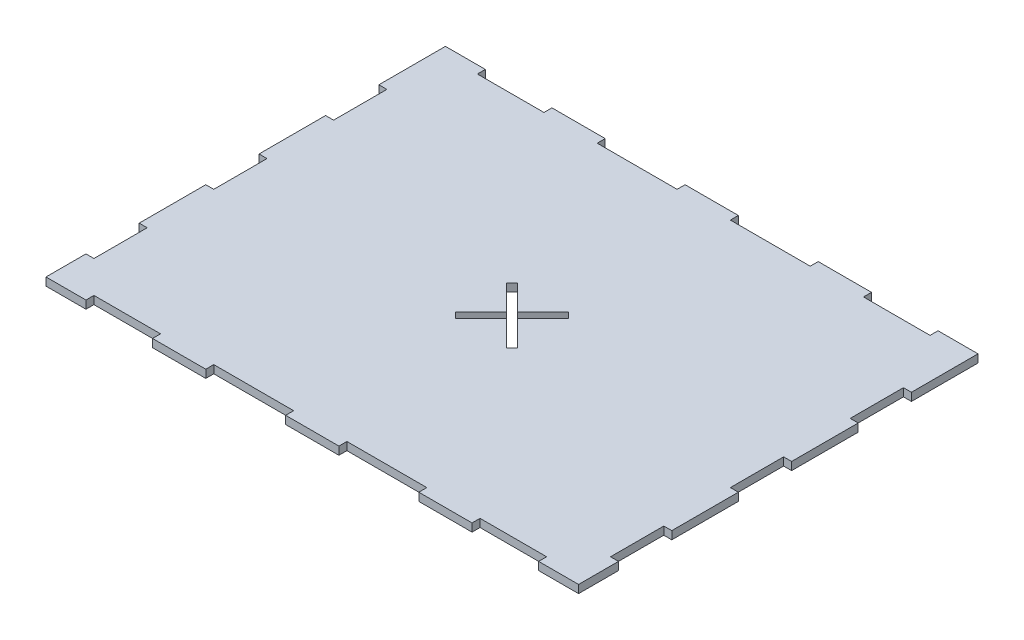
ISO-10303-21;
HEADER;
FILE_DESCRIPTION(('STEP AP214'),'2;1');
FILE_NAME('part.step','',(''),(''),'','','');
FILE_SCHEMA(('AUTOMOTIVE_DESIGN { 1 0 10303 214 1 1 1 1 }'));
ENDSEC;
DATA;
#1=APPLICATION_CONTEXT('core data for automotive mechanical design processes');
#2=APPLICATION_PROTOCOL_DEFINITION('international standard','automotive_design',2000,#1);
#3=PRODUCT_CONTEXT('',#1,'mechanical');
#4=PRODUCT('Part','Part','',(#3));
#5=PRODUCT_RELATED_PRODUCT_CATEGORY('part','',(#4));
#6=PRODUCT_DEFINITION_FORMATION('','',#4);
#7=PRODUCT_DEFINITION_CONTEXT('part definition',#1,'design');
#8=PRODUCT_DEFINITION('design','',#6,#7);
#9=PRODUCT_DEFINITION_SHAPE('','',#8);
#10=(LENGTH_UNIT() NAMED_UNIT(*) SI_UNIT(.MILLI.,.METRE.));
#11=(NAMED_UNIT(*) PLANE_ANGLE_UNIT() SI_UNIT($,.RADIAN.));
#12=(NAMED_UNIT(*) SI_UNIT($,.STERADIAN.) SOLID_ANGLE_UNIT());
#13=UNCERTAINTY_MEASURE_WITH_UNIT(LENGTH_MEASURE(1.E-05),#10,'distance_accuracy_value','');
#14=(GEOMETRIC_REPRESENTATION_CONTEXT(3) GLOBAL_UNCERTAINTY_ASSIGNED_CONTEXT((#13)) GLOBAL_UNIT_ASSIGNED_CONTEXT((#10,
#11,#12)) REPRESENTATION_CONTEXT('',''));
#15=CARTESIAN_POINT('',(0.,0.,0.));
#16=DIRECTION('',(0.,0.,1.));
#17=DIRECTION('',(1.,0.,0.));
#18=AXIS2_PLACEMENT_3D('',#15,#16,#17);
#19=CARTESIAN_POINT('',(0.,3.,0.));
#20=DIRECTION('',(1.,0.,0.));
#21=DIRECTION('',(0.,0.,-1.));
#22=AXIS2_PLACEMENT_3D('',#19,#20,#21);
#23=PLANE('',#22);
#24=DIRECTION('',(0.,0.,1.));
#25=VECTOR('',#24,1.);
#26=CARTESIAN_POINT('',(0.,0.,0.));
#27=LINE('',#26,#25);
#28=CARTESIAN_POINT('',(0.,0.,-150.));
#29=VERTEX_POINT('',#28);
#30=CARTESIAN_POINT('',(0.,0.,-125.));
#31=VERTEX_POINT('',#30);
#32=EDGE_CURVE('E817',#29,#31,#27,.T.);
#33=ORIENTED_EDGE('',*,*,#32,.T.);
#34=DIRECTION('',(0.,1.,0.));
#35=VECTOR('',#34,1.);
#36=CARTESIAN_POINT('',(0.,-3.,-125.));
#37=LINE('',#36,#35);
#38=CARTESIAN_POINT('',(0.,3.,-125.));
#39=VERTEX_POINT('',#38);
#40=EDGE_CURVE('E633',#31,#39,#37,.T.);
#41=ORIENTED_EDGE('',*,*,#40,.T.);
#42=DIRECTION('',(0.,0.,1.));
#43=VECTOR('',#42,1.);
#44=CARTESIAN_POINT('',(0.,3.,0.));
#45=LINE('',#44,#43);
#46=CARTESIAN_POINT('',(0.,3.,-150.));
#47=VERTEX_POINT('',#46);
#48=EDGE_CURVE('E797',#47,#39,#45,.T.);
#49=ORIENTED_EDGE('',*,*,#48,.F.);
#50=DIRECTION('',(0.,-1.,0.));
#51=VECTOR('',#50,1.);
#52=CARTESIAN_POINT('',(0.,3.,-150.));
#53=LINE('',#52,#51);
#54=EDGE_CURVE('E815',#47,#29,#53,.T.);
#55=ORIENTED_EDGE('',*,*,#54,.T.);
#56=EDGE_LOOP('',(#33,#41,#49,#55));
#57=FACE_BOUND('',#56,.T.);
#58=ADVANCED_FACE('F36',(#57),#23,.F.);
#59=CARTESIAN_POINT('',(0.,3.,-15.));
#60=VERTEX_POINT('',#59);
#61=CARTESIAN_POINT('',(0.,3.,0.));
#62=VERTEX_POINT('',#61);
#63=EDGE_CURVE('E802',#60,#62,#45,.T.);
#64=ORIENTED_EDGE('',*,*,#63,.F.);
#65=DIRECTION('',(0.,1.,0.));
#66=VECTOR('',#65,1.);
#67=CARTESIAN_POINT('',(0.,-3.,-15.));
#68=LINE('',#67,#66);
#69=CARTESIAN_POINT('',(0.,0.,-15.));
#70=VERTEX_POINT('',#69);
#71=EDGE_CURVE('E675',#70,#60,#68,.T.);
#72=ORIENTED_EDGE('',*,*,#71,.F.);
#73=CARTESIAN_POINT('',(0.,0.,0.));
#74=VERTEX_POINT('',#73);
#75=EDGE_CURVE('E775',#70,#74,#27,.T.);
#76=ORIENTED_EDGE('',*,*,#75,.T.);
#77=DIRECTION('',(0.,-1.,0.));
#78=VECTOR('',#77,1.);
#79=CARTESIAN_POINT('',(0.,3.,0.));
#80=LINE('',#79,#78);
#81=EDGE_CURVE('E844',#62,#74,#80,.T.);
#82=ORIENTED_EDGE('',*,*,#81,.F.);
#83=EDGE_LOOP('',(#64,#72,#76,#82));
#84=FACE_BOUND('',#83,.T.);
#85=ADVANCED_FACE('F1102',(#84),#23,.F.);
#86=CARTESIAN_POINT('',(0.,3.,-105.));
#87=VERTEX_POINT('',#86);
#88=CARTESIAN_POINT('',(0.,3.,-80.));
#89=VERTEX_POINT('',#88);
#90=EDGE_CURVE('E801',#87,#89,#45,.T.);
#91=ORIENTED_EDGE('',*,*,#90,.F.);
#92=DIRECTION('',(0.,1.,0.));
#93=VECTOR('',#92,1.);
#94=CARTESIAN_POINT('',(0.,-3.,-105.));
#95=LINE('',#94,#93);
#96=CARTESIAN_POINT('',(0.,0.,-105.));
#97=VERTEX_POINT('',#96);
#98=EDGE_CURVE('E637',#97,#87,#95,.T.);
#99=ORIENTED_EDGE('',*,*,#98,.F.);
#100=CARTESIAN_POINT('',(0.,0.,-80.));
#101=VERTEX_POINT('',#100);
#102=EDGE_CURVE('E821',#97,#101,#27,.T.);
#103=ORIENTED_EDGE('',*,*,#102,.T.);
#104=DIRECTION('',(0.,1.,0.));
#105=VECTOR('',#104,1.);
#106=CARTESIAN_POINT('',(0.,-3.,-80.));
#107=LINE('',#106,#105);
#108=EDGE_CURVE('E582',#101,#89,#107,.T.);
#109=ORIENTED_EDGE('',*,*,#108,.T.);
#110=EDGE_LOOP('',(#91,#99,#103,#109));
#111=FACE_BOUND('',#110,.T.);
#112=ADVANCED_FACE('F1085',(#111),#23,.F.);
#113=CARTESIAN_POINT('',(0.,3.,0.));
#114=DIRECTION('',(0.,0.,-1.));
#115=DIRECTION('',(-1.,0.,0.));
#116=AXIS2_PLACEMENT_3D('',#113,#114,#115);
#117=PLANE('',#116);
#118=DIRECTION('',(1.,0.,0.));
#119=VECTOR('',#118,1.);
#120=CARTESIAN_POINT('',(0.,0.,0.));
#121=LINE('',#120,#119);
#122=CARTESIAN_POINT('',(90.,0.,0.));
#123=VERTEX_POINT('',#122);
#124=CARTESIAN_POINT('',(110.,0.,0.));
#125=VERTEX_POINT('',#124);
#126=EDGE_CURVE('E1146',#123,#125,#121,.T.);
#127=ORIENTED_EDGE('',*,*,#126,.T.);
#128=DIRECTION('',(0.,1.,0.));
#129=VECTOR('',#128,1.);
#130=CARTESIAN_POINT('',(110.,-3.,0.));
#131=LINE('',#130,#129);
#132=CARTESIAN_POINT('',(110.,3.,0.));
#133=VERTEX_POINT('',#132);
#134=EDGE_CURVE('E645',#125,#133,#131,.T.);
#135=ORIENTED_EDGE('',*,*,#134,.T.);
#136=DIRECTION('',(1.,0.,0.));
#137=VECTOR('',#136,1.);
#138=CARTESIAN_POINT('',(0.,3.,0.));
#139=LINE('',#138,#137);
#140=CARTESIAN_POINT('',(90.,3.,0.));
#141=VERTEX_POINT('',#140);
#142=EDGE_CURVE('E981',#141,#133,#139,.T.);
#143=ORIENTED_EDGE('',*,*,#142,.F.);
#144=DIRECTION('',(0.,1.,0.));
#145=VECTOR('',#144,1.);
#146=CARTESIAN_POINT('',(90.,-3.,0.));
#147=LINE('',#146,#145);
#148=EDGE_CURVE('E550',#123,#141,#147,.T.);
#149=ORIENTED_EDGE('',*,*,#148,.F.);
#150=EDGE_LOOP('',(#127,#135,#143,#149));
#151=FACE_BOUND('',#150,.T.);
#152=ADVANCED_FACE('F1145',(#151),#117,.F.);
#153=CARTESIAN_POINT('',(185.,3.,0.));
#154=VERTEX_POINT('',#153);
#155=CARTESIAN_POINT('',(200.,3.,0.));
#156=VERTEX_POINT('',#155);
#157=EDGE_CURVE('E800',#154,#156,#139,.T.);
#158=ORIENTED_EDGE('',*,*,#157,.F.);
#159=DIRECTION('',(0.,1.,0.));
#160=VECTOR('',#159,1.);
#161=CARTESIAN_POINT('',(185.,-3.,0.));
#162=LINE('',#161,#160);
#163=CARTESIAN_POINT('',(185.,0.,0.));
#164=VERTEX_POINT('',#163);
#165=EDGE_CURVE('E652',#164,#154,#162,.T.);
#166=ORIENTED_EDGE('',*,*,#165,.F.);
#167=CARTESIAN_POINT('',(200.,0.,0.));
#168=VERTEX_POINT('',#167);
#169=EDGE_CURVE('E820',#164,#168,#121,.T.);
#170=ORIENTED_EDGE('',*,*,#169,.T.);
#171=DIRECTION('',(0.,-1.,0.));
#172=VECTOR('',#171,1.);
#173=CARTESIAN_POINT('',(200.,3.,0.));
#174=LINE('',#173,#172);
#175=EDGE_CURVE('E841',#156,#168,#174,.T.);
#176=ORIENTED_EDGE('',*,*,#175,.F.);
#177=EDGE_LOOP('',(#158,#166,#170,#176));
#178=FACE_BOUND('',#177,.T.);
#179=ADVANCED_FACE('F990',(#178),#117,.F.);
#180=CARTESIAN_POINT('',(15.,0.,0.));
#181=VERTEX_POINT('',#180);
#182=EDGE_CURVE('E822',#74,#181,#121,.T.);
#183=ORIENTED_EDGE('',*,*,#182,.T.);
#184=DIRECTION('',(0.,1.,0.));
#185=VECTOR('',#184,1.);
#186=CARTESIAN_POINT('',(15.,-3.,0.));
#187=LINE('',#186,#185);
#188=CARTESIAN_POINT('',(15.,3.,0.));
#189=VERTEX_POINT('',#188);
#190=EDGE_CURVE('E541',#181,#189,#187,.T.);
#191=ORIENTED_EDGE('',*,*,#190,.T.);
#192=EDGE_CURVE('E803',#62,#189,#139,.T.);
#193=ORIENTED_EDGE('',*,*,#192,.F.);
#194=ORIENTED_EDGE('',*,*,#81,.T.);
#195=EDGE_LOOP('',(#183,#191,#193,#194));
#196=FACE_BOUND('',#195,.T.);
#197=ADVANCED_FACE('F1101',(#196),#117,.F.);
#198=CARTESIAN_POINT('',(140.,3.,0.));
#199=VERTEX_POINT('',#198);
#200=CARTESIAN_POINT('',(160.,3.,0.));
#201=VERTEX_POINT('',#200);
#202=EDGE_CURVE('E979',#199,#201,#139,.T.);
#203=ORIENTED_EDGE('',*,*,#202,.F.);
#204=DIRECTION('',(0.,1.,0.));
#205=VECTOR('',#204,1.);
#206=CARTESIAN_POINT('',(140.,-3.,0.));
#207=LINE('',#206,#205);
#208=CARTESIAN_POINT('',(140.,0.,0.));
#209=VERTEX_POINT('',#208);
#210=EDGE_CURVE('E664',#209,#199,#207,.T.);
#211=ORIENTED_EDGE('',*,*,#210,.F.);
#212=CARTESIAN_POINT('',(160.,0.,0.));
#213=VERTEX_POINT('',#212);
#214=EDGE_CURVE('E971',#209,#213,#121,.T.);
#215=ORIENTED_EDGE('',*,*,#214,.T.);
#216=DIRECTION('',(0.,1.,0.));
#217=VECTOR('',#216,1.);
#218=CARTESIAN_POINT('',(160.,-3.,0.));
#219=LINE('',#218,#217);
#220=EDGE_CURVE('E654',#213,#201,#219,.T.);
#221=ORIENTED_EDGE('',*,*,#220,.T.);
#222=EDGE_LOOP('',(#203,#211,#215,#221));
#223=FACE_BOUND('',#222,.T.);
#224=ADVANCED_FACE('F977',(#223),#117,.F.);
#225=CARTESIAN_POINT('',(200.,3.,0.));
#226=DIRECTION('',(-1.,0.,0.));
#227=DIRECTION('',(0.,0.,1.));
#228=AXIS2_PLACEMENT_3D('',#225,#226,#227);
#229=PLANE('',#228);
#230=DIRECTION('',(0.,0.,-1.));
#231=VECTOR('',#230,1.);
#232=CARTESIAN_POINT('',(200.,3.,0.));
#233=LINE('',#232,#231);
#234=CARTESIAN_POINT('',(200.,3.,-125.));
#235=VERTEX_POINT('',#234);
#236=CARTESIAN_POINT('',(200.,3.,-150.));
#237=VERTEX_POINT('',#236);
#238=EDGE_CURVE('E806',#235,#237,#233,.T.);
#239=ORIENTED_EDGE('',*,*,#238,.F.);
#240=DIRECTION('',(0.,1.,0.));
#241=VECTOR('',#240,1.);
#242=CARTESIAN_POINT('',(200.,-3.,-125.));
#243=LINE('',#242,#241);
#244=CARTESIAN_POINT('',(200.,0.,-125.));
#245=VERTEX_POINT('',#244);
#246=EDGE_CURVE('E531',#245,#235,#243,.T.);
#247=ORIENTED_EDGE('',*,*,#246,.F.);
#248=DIRECTION('',(0.,0.,-1.));
#249=VECTOR('',#248,1.);
#250=CARTESIAN_POINT('',(200.,0.,0.));
#251=LINE('',#250,#249);
#252=CARTESIAN_POINT('',(200.,0.,-150.));
#253=VERTEX_POINT('',#252);
#254=EDGE_CURVE('E825',#245,#253,#251,.T.);
#255=ORIENTED_EDGE('',*,*,#254,.T.);
#256=DIRECTION('',(0.,-1.,0.));
#257=VECTOR('',#256,1.);
#258=CARTESIAN_POINT('',(200.,3.,-150.));
#259=LINE('',#258,#257);
#260=EDGE_CURVE('E838',#237,#253,#259,.T.);
#261=ORIENTED_EDGE('',*,*,#260,.F.);
#262=EDGE_LOOP('',(#239,#247,#255,#261));
#263=FACE_BOUND('',#262,.T.);
#264=ADVANCED_FACE('F1022',(#263),#229,.F.);
#265=CARTESIAN_POINT('',(200.,0.,-80.));
#266=VERTEX_POINT('',#265);
#267=CARTESIAN_POINT('',(200.,0.,-105.));
#268=VERTEX_POINT('',#267);
#269=EDGE_CURVE('E1807',#266,#268,#251,.T.);
#270=ORIENTED_EDGE('',*,*,#269,.T.);
#271=DIRECTION('',(0.,1.,0.));
#272=VECTOR('',#271,1.);
#273=CARTESIAN_POINT('',(200.,-3.,-105.));
#274=LINE('',#273,#272);
#275=CARTESIAN_POINT('',(200.,3.,-105.));
#276=VERTEX_POINT('',#275);
#277=EDGE_CURVE('E533',#268,#276,#274,.T.);
#278=ORIENTED_EDGE('',*,*,#277,.T.);
#279=CARTESIAN_POINT('',(200.,3.,-80.));
#280=VERTEX_POINT('',#279);
#281=EDGE_CURVE('E1010',#280,#276,#233,.T.);
#282=ORIENTED_EDGE('',*,*,#281,.F.);
#283=DIRECTION('',(0.,1.,0.));
#284=VECTOR('',#283,1.);
#285=CARTESIAN_POINT('',(200.,-3.,-80.));
#286=LINE('',#285,#284);
#287=EDGE_CURVE('E518',#266,#280,#286,.T.);
#288=ORIENTED_EDGE('',*,*,#287,.F.);
#289=EDGE_LOOP('',(#270,#278,#282,#288));
#290=FACE_BOUND('',#289,.T.);
#291=ADVANCED_FACE('F1749',(#290),#229,.F.);
#292=CARTESIAN_POINT('',(200.,0.,-15.));
#293=VERTEX_POINT('',#292);
#294=EDGE_CURVE('E827',#168,#293,#251,.T.);
#295=ORIENTED_EDGE('',*,*,#294,.T.);
#296=DIRECTION('',(0.,1.,0.));
#297=VECTOR('',#296,1.);
#298=CARTESIAN_POINT('',(200.,-3.,-15.));
#299=LINE('',#298,#297);
#300=CARTESIAN_POINT('',(200.,3.,-15.));
#301=VERTEX_POINT('',#300);
#302=EDGE_CURVE('E597',#293,#301,#299,.T.);
#303=ORIENTED_EDGE('',*,*,#302,.T.);
#304=EDGE_CURVE('E808',#156,#301,#233,.T.);
#305=ORIENTED_EDGE('',*,*,#304,.F.);
#306=ORIENTED_EDGE('',*,*,#175,.T.);
#307=EDGE_LOOP('',(#295,#303,#305,#306));
#308=FACE_BOUND('',#307,.T.);
#309=ADVANCED_FACE('F994',(#308),#229,.F.);
#310=CARTESIAN_POINT('',(0.,3.,-150.));
#311=DIRECTION('',(0.,0.,1.));
#312=DIRECTION('',(1.,0.,0.));
#313=AXIS2_PLACEMENT_3D('',#310,#311,#312);
#314=PLANE('',#313);
#315=DIRECTION('',(-1.,0.,0.));
#316=VECTOR('',#315,1.);
#317=CARTESIAN_POINT('',(0.,0.,-150.));
#318=LINE('',#317,#316);
#319=CARTESIAN_POINT('',(185.,0.,-150.));
#320=VERTEX_POINT('',#319);
#321=EDGE_CURVE('E832',#253,#320,#318,.T.);
#322=ORIENTED_EDGE('',*,*,#321,.T.);
#323=DIRECTION('',(0.,1.,0.));
#324=VECTOR('',#323,1.);
#325=CARTESIAN_POINT('',(185.,-3.,-150.));
#326=LINE('',#325,#324);
#327=CARTESIAN_POINT('',(185.,3.,-150.));
#328=VERTEX_POINT('',#327);
#329=EDGE_CURVE('E614',#320,#328,#326,.T.);
#330=ORIENTED_EDGE('',*,*,#329,.T.);
#331=DIRECTION('',(-1.,0.,0.));
#332=VECTOR('',#331,1.);
#333=CARTESIAN_POINT('',(0.,3.,-150.));
#334=LINE('',#333,#332);
#335=EDGE_CURVE('E812',#237,#328,#334,.T.);
#336=ORIENTED_EDGE('',*,*,#335,.F.);
#337=ORIENTED_EDGE('',*,*,#260,.T.);
#338=EDGE_LOOP('',(#322,#330,#336,#337));
#339=FACE_BOUND('',#338,.T.);
#340=ADVANCED_FACE('F1026',(#339),#314,.F.);
#341=CARTESIAN_POINT('',(160.,3.,-150.));
#342=VERTEX_POINT('',#341);
#343=CARTESIAN_POINT('',(140.,3.,-150.));
#344=VERTEX_POINT('',#343);
#345=EDGE_CURVE('E816',#342,#344,#334,.T.);
#346=ORIENTED_EDGE('',*,*,#345,.F.);
#347=DIRECTION('',(0.,1.,0.));
#348=VECTOR('',#347,1.);
#349=CARTESIAN_POINT('',(160.,-3.,-150.));
#350=LINE('',#349,#348);
#351=CARTESIAN_POINT('',(160.,0.,-150.));
#352=VERTEX_POINT('',#351);
#353=EDGE_CURVE('E620',#352,#342,#350,.T.);
#354=ORIENTED_EDGE('',*,*,#353,.F.);
#355=CARTESIAN_POINT('',(140.,0.,-150.));
#356=VERTEX_POINT('',#355);
#357=EDGE_CURVE('E835',#352,#356,#318,.T.);
#358=ORIENTED_EDGE('',*,*,#357,.T.);
#359=DIRECTION('',(0.,1.,0.));
#360=VECTOR('',#359,1.);
#361=CARTESIAN_POINT('',(140.,-3.,-150.));
#362=LINE('',#361,#360);
#363=EDGE_CURVE('E730',#356,#344,#362,.T.);
#364=ORIENTED_EDGE('',*,*,#363,.T.);
#365=EDGE_LOOP('',(#346,#354,#358,#364));
#366=FACE_BOUND('',#365,.T.);
#367=ADVANCED_FACE('F1044',(#366),#314,.F.);
#368=CARTESIAN_POINT('',(110.,3.,-150.));
#369=VERTEX_POINT('',#368);
#370=CARTESIAN_POINT('',(90.,3.,-150.));
#371=VERTEX_POINT('',#370);
#372=EDGE_CURVE('E1046',#369,#371,#334,.T.);
#373=ORIENTED_EDGE('',*,*,#372,.F.);
#374=DIRECTION('',(0.,1.,0.));
#375=VECTOR('',#374,1.);
#376=CARTESIAN_POINT('',(110.,-3.,-150.));
#377=LINE('',#376,#375);
#378=CARTESIAN_POINT('',(110.,0.,-150.));
#379=VERTEX_POINT('',#378);
#380=EDGE_CURVE('E734',#379,#369,#377,.T.);
#381=ORIENTED_EDGE('',*,*,#380,.F.);
#382=CARTESIAN_POINT('',(90.,0.,-150.));
#383=VERTEX_POINT('',#382);
#384=EDGE_CURVE('E1817',#379,#383,#318,.T.);
#385=ORIENTED_EDGE('',*,*,#384,.T.);
#386=DIRECTION('',(0.,1.,0.));
#387=VECTOR('',#386,1.);
#388=CARTESIAN_POINT('',(90.,-3.,-150.));
#389=LINE('',#388,#387);
#390=EDGE_CURVE('E715',#383,#371,#389,.T.);
#391=ORIENTED_EDGE('',*,*,#390,.T.);
#392=EDGE_LOOP('',(#373,#381,#385,#391));
#393=FACE_BOUND('',#392,.T.);
#394=ADVANCED_FACE('F1172',(#393),#314,.F.);
#395=CARTESIAN_POINT('',(15.,3.,-150.));
#396=VERTEX_POINT('',#395);
#397=EDGE_CURVE('E811',#396,#47,#334,.T.);
#398=ORIENTED_EDGE('',*,*,#397,.F.);
#399=DIRECTION('',(0.,1.,0.));
#400=VECTOR('',#399,1.);
#401=CARTESIAN_POINT('',(15.,-3.,-150.));
#402=LINE('',#401,#400);
#403=CARTESIAN_POINT('',(15.,0.,-150.));
#404=VERTEX_POINT('',#403);
#405=EDGE_CURVE('E681',#404,#396,#402,.T.);
#406=ORIENTED_EDGE('',*,*,#405,.F.);
#407=EDGE_CURVE('E830',#404,#29,#318,.T.);
#408=ORIENTED_EDGE('',*,*,#407,.T.);
#409=ORIENTED_EDGE('',*,*,#54,.F.);
#410=EDGE_LOOP('',(#398,#406,#408,#409));
#411=FACE_BOUND('',#410,.T.);
#412=ADVANCED_FACE('F1064',(#411),#314,.F.);
#413=CARTESIAN_POINT('',(0.,0.,-60.));
#414=VERTEX_POINT('',#413);
#415=CARTESIAN_POINT('',(0.,0.,-35.));
#416=VERTEX_POINT('',#415);
#417=EDGE_CURVE('E1106',#414,#416,#27,.T.);
#418=ORIENTED_EDGE('',*,*,#417,.T.);
#419=DIRECTION('',(0.,1.,0.));
#420=VECTOR('',#419,1.);
#421=CARTESIAN_POINT('',(0.,-3.,-35.));
#422=LINE('',#421,#420);
#423=CARTESIAN_POINT('',(0.,3.,-35.));
#424=VERTEX_POINT('',#423);
#425=EDGE_CURVE('E700',#416,#424,#422,.T.);
#426=ORIENTED_EDGE('',*,*,#425,.T.);
#427=CARTESIAN_POINT('',(0.,3.,-60.));
#428=VERTEX_POINT('',#427);
#429=EDGE_CURVE('E1087',#428,#424,#45,.T.);
#430=ORIENTED_EDGE('',*,*,#429,.F.);
#431=DIRECTION('',(0.,1.,0.));
#432=VECTOR('',#431,1.);
#433=CARTESIAN_POINT('',(0.,-3.,-60.));
#434=LINE('',#433,#432);
#435=EDGE_CURVE('E586',#414,#428,#434,.T.);
#436=ORIENTED_EDGE('',*,*,#435,.F.);
#437=EDGE_LOOP('',(#418,#426,#430,#436));
#438=FACE_BOUND('',#437,.T.);
#439=ADVANCED_FACE('F38',(#438),#23,.F.);
#440=CARTESIAN_POINT('',(40.,3.,0.));
#441=VERTEX_POINT('',#440);
#442=CARTESIAN_POINT('',(60.,3.,0.));
#443=VERTEX_POINT('',#442);
#444=EDGE_CURVE('E807',#441,#443,#139,.T.);
#445=ORIENTED_EDGE('',*,*,#444,.F.);
#446=DIRECTION('',(0.,1.,0.));
#447=VECTOR('',#446,1.);
#448=CARTESIAN_POINT('',(40.,-3.,0.));
#449=LINE('',#448,#447);
#450=CARTESIAN_POINT('',(40.,0.,0.));
#451=VERTEX_POINT('',#450);
#452=EDGE_CURVE('E565',#451,#441,#449,.T.);
#453=ORIENTED_EDGE('',*,*,#452,.F.);
#454=CARTESIAN_POINT('',(60.,0.,0.));
#455=VERTEX_POINT('',#454);
#456=EDGE_CURVE('E826',#451,#455,#121,.T.);
#457=ORIENTED_EDGE('',*,*,#456,.T.);
#458=DIRECTION('',(0.,1.,0.));
#459=VECTOR('',#458,1.);
#460=CARTESIAN_POINT('',(60.,-3.,0.));
#461=LINE('',#460,#459);
#462=EDGE_CURVE('E552',#455,#443,#461,.T.);
#463=ORIENTED_EDGE('',*,*,#462,.T.);
#464=EDGE_LOOP('',(#445,#453,#457,#463));
#465=FACE_BOUND('',#464,.T.);
#466=ADVANCED_FACE('F1123',(#465),#117,.F.);
#467=CARTESIAN_POINT('',(200.,0.,-35.));
#468=VERTEX_POINT('',#467);
#469=CARTESIAN_POINT('',(200.,0.,-60.));
#470=VERTEX_POINT('',#469);
#471=EDGE_CURVE('E831',#468,#470,#251,.T.);
#472=ORIENTED_EDGE('',*,*,#471,.T.);
#473=DIRECTION('',(0.,1.,0.));
#474=VECTOR('',#473,1.);
#475=CARTESIAN_POINT('',(200.,-3.,-60.));
#476=LINE('',#475,#474);
#477=CARTESIAN_POINT('',(200.,3.,-60.));
#478=VERTEX_POINT('',#477);
#479=EDGE_CURVE('E494',#470,#478,#476,.T.);
#480=ORIENTED_EDGE('',*,*,#479,.T.);
#481=CARTESIAN_POINT('',(200.,3.,-35.));
#482=VERTEX_POINT('',#481);
#483=EDGE_CURVE('E512',#482,#478,#233,.T.);
#484=ORIENTED_EDGE('',*,*,#483,.F.);
#485=DIRECTION('',(0.,1.,0.));
#486=VECTOR('',#485,1.);
#487=CARTESIAN_POINT('',(200.,-3.,-35.));
#488=LINE('',#487,#486);
#489=EDGE_CURVE('E601',#468,#482,#488,.T.);
#490=ORIENTED_EDGE('',*,*,#489,.F.);
#491=EDGE_LOOP('',(#472,#480,#484,#490));
#492=FACE_BOUND('',#491,.T.);
#493=ADVANCED_FACE('F1009',(#492),#229,.F.);
#494=CARTESIAN_POINT('',(60.,3.,-150.));
#495=VERTEX_POINT('',#494);
#496=CARTESIAN_POINT('',(40.,3.,-150.));
#497=VERTEX_POINT('',#496);
#498=EDGE_CURVE('E1048',#495,#497,#334,.T.);
#499=ORIENTED_EDGE('',*,*,#498,.F.);
#500=DIRECTION('',(0.,1.,0.));
#501=VECTOR('',#500,1.);
#502=CARTESIAN_POINT('',(60.,-3.,-150.));
#503=LINE('',#502,#501);
#504=CARTESIAN_POINT('',(60.,0.,-150.));
#505=VERTEX_POINT('',#504);
#506=EDGE_CURVE('E719',#505,#495,#503,.T.);
#507=ORIENTED_EDGE('',*,*,#506,.F.);
#508=CARTESIAN_POINT('',(40.,0.,-150.));
#509=VERTEX_POINT('',#508);
#510=EDGE_CURVE('E1827',#505,#509,#318,.T.);
#511=ORIENTED_EDGE('',*,*,#510,.T.);
#512=DIRECTION('',(0.,1.,0.));
#513=VECTOR('',#512,1.);
#514=CARTESIAN_POINT('',(40.,-3.,-150.));
#515=LINE('',#514,#513);
#516=EDGE_CURVE('E683',#509,#497,#515,.T.);
#517=ORIENTED_EDGE('',*,*,#516,.T.);
#518=EDGE_LOOP('',(#499,#507,#511,#517));
#519=FACE_BOUND('',#518,.T.);
#520=ADVANCED_FACE('F1174',(#519),#314,.F.);
#521=CARTESIAN_POINT('',(0.,3.,0.));
#522=DIRECTION('',(0.,-1.,0.));
#523=DIRECTION('',(0.,0.,-1.));
#524=AXIS2_PLACEMENT_3D('',#521,#522,#523);
#525=PLANE('',#524);
#526=DIRECTION('',(-0.707106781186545,0.,-0.70710678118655));
#527=VECTOR('',#526,1.);
#528=CARTESIAN_POINT('',(109.545941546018,3.,-86.6672618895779));
#529=LINE('',#528,#527);
#530=CARTESIAN_POINT('',(111.667261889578,3.,-84.5459415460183));
#531=VERTEX_POINT('',#530);
#532=CARTESIAN_POINT('',(109.545941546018,3.,-86.6672618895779));
#533=VERTEX_POINT('',#532);
#534=EDGE_CURVE('E739',#531,#533,#529,.T.);
#535=ORIENTED_EDGE('',*,*,#534,.F.);
#536=DIRECTION('',(0.707106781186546,0.,-0.707106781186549));
#537=VECTOR('',#536,1.);
#538=CARTESIAN_POINT('',(102.12132034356,3.,-75.));
#539=LINE('',#538,#537);
#540=CARTESIAN_POINT('',(102.12132034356,3.,-75.));
#541=VERTEX_POINT('',#540);
#542=EDGE_CURVE('E51',#541,#531,#539,.T.);
#543=ORIENTED_EDGE('',*,*,#542,.F.);
#544=DIRECTION('',(-0.707106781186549,0.,-0.707106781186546));
#545=VECTOR('',#544,1.);
#546=CARTESIAN_POINT('',(102.12132034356,3.,-75.));
#547=LINE('',#546,#545);
#548=CARTESIAN_POINT('',(111.667261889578,3.,-65.4540584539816));
#549=VERTEX_POINT('',#548);
#550=EDGE_CURVE('E769',#549,#541,#547,.T.);
#551=ORIENTED_EDGE('',*,*,#550,.F.);
#552=DIRECTION('',(0.707106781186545,0.,-0.70710678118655));
#553=VECTOR('',#552,1.);
#554=CARTESIAN_POINT('',(109.545941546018,3.,-63.3327381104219));
#555=LINE('',#554,#553);
#556=CARTESIAN_POINT('',(109.545941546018,3.,-63.3327381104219));
#557=VERTEX_POINT('',#556);
#558=EDGE_CURVE('E766',#557,#549,#555,.T.);
#559=ORIENTED_EDGE('',*,*,#558,.F.);
#560=DIRECTION('',(0.707106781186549,0.,0.707106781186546));
#561=VECTOR('',#560,1.);
#562=CARTESIAN_POINT('',(99.9999999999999,3.,-72.8786796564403));
#563=LINE('',#562,#561);
#564=CARTESIAN_POINT('',(99.9999999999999,3.,-72.8786796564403));
#565=VERTEX_POINT('',#564);
#566=EDGE_CURVE('E763',#565,#557,#563,.T.);
#567=ORIENTED_EDGE('',*,*,#566,.F.);
#568=DIRECTION('',(0.707106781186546,0.,-0.707106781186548));
#569=VECTOR('',#568,1.);
#570=CARTESIAN_POINT('',(90.4540584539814,3.,-63.3327381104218));
#571=LINE('',#570,#569);
#572=CARTESIAN_POINT('',(90.4540584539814,3.,-63.3327381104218));
#573=VERTEX_POINT('',#572);
#574=EDGE_CURVE('E760',#573,#565,#571,.T.);
#575=ORIENTED_EDGE('',*,*,#574,.F.);
#576=DIRECTION('',(0.707106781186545,0.,0.70710678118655));
#577=VECTOR('',#576,1.);
#578=CARTESIAN_POINT('',(88.3327381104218,3.,-65.4540584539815));
#579=LINE('',#578,#577);
#580=CARTESIAN_POINT('',(88.3327381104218,3.,-65.4540584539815));
#581=VERTEX_POINT('',#580);
#582=EDGE_CURVE('E757',#581,#573,#579,.T.);
#583=ORIENTED_EDGE('',*,*,#582,.F.);
#584=DIRECTION('',(-0.707106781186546,0.,0.707106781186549));
#585=VECTOR('',#584,1.);
#586=CARTESIAN_POINT('',(88.3327381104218,3.,-65.4540584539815));
#587=LINE('',#586,#585);
#588=CARTESIAN_POINT('',(97.8786796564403,3.,-75.));
#589=VERTEX_POINT('',#588);
#590=EDGE_CURVE('E754',#589,#581,#587,.T.);
#591=ORIENTED_EDGE('',*,*,#590,.F.);
#592=DIRECTION('',(0.707106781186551,0.,0.707106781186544));
#593=VECTOR('',#592,1.);
#594=CARTESIAN_POINT('',(88.3327381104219,3.,-84.5459415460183));
#595=LINE('',#594,#593);
#596=CARTESIAN_POINT('',(88.3327381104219,3.,-84.5459415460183));
#597=VERTEX_POINT('',#596);
#598=EDGE_CURVE('E751',#597,#589,#595,.T.);
#599=ORIENTED_EDGE('',*,*,#598,.F.);
#600=DIRECTION('',(-0.707106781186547,0.,0.707106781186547));
#601=VECTOR('',#600,1.);
#602=CARTESIAN_POINT('',(88.3327381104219,3.,-84.5459415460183));
#603=LINE('',#602,#601);
#604=CARTESIAN_POINT('',(90.4540584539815,3.,-86.6672618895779));
#605=VERTEX_POINT('',#604);
#606=EDGE_CURVE('E748',#605,#597,#603,.T.);
#607=ORIENTED_EDGE('',*,*,#606,.F.);
#608=DIRECTION('',(-0.70710678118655,0.,-0.707106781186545));
#609=VECTOR('',#608,1.);
#610=CARTESIAN_POINT('',(90.4540584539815,3.,-86.6672618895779));
#611=LINE('',#610,#609);
#612=CARTESIAN_POINT('',(99.9999999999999,3.,-77.1213203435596));
#613=VERTEX_POINT('',#612);
#614=EDGE_CURVE('E745',#613,#605,#611,.T.);
#615=ORIENTED_EDGE('',*,*,#614,.F.);
#616=DIRECTION('',(-0.707106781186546,0.,0.707106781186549));
#617=VECTOR('',#616,1.);
#618=CARTESIAN_POINT('',(99.9999999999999,3.,-77.1213203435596));
#619=LINE('',#618,#617);
#620=EDGE_CURVE('E742',#533,#613,#619,.T.);
#621=ORIENTED_EDGE('',*,*,#620,.F.);
#622=EDGE_LOOP('',(#535,#543,#551,#559,#567,#575,#583,#591,#599,#607,#615,#621));
#623=FACE_BOUND('',#622,.T.);
#624=ORIENTED_EDGE('',*,*,#142,.T.);
#625=DIRECTION('',(0.,0.,1.));
#626=VECTOR('',#625,1.);
#627=CARTESIAN_POINT('',(110.,3.,0.));
#628=LINE('',#627,#626);
#629=CARTESIAN_POINT('',(110.,3.,-3.));
#630=VERTEX_POINT('',#629);
#631=EDGE_CURVE('E662',#630,#133,#628,.T.);
#632=ORIENTED_EDGE('',*,*,#631,.F.);
#633=DIRECTION('',(-1.,0.,0.));
#634=VECTOR('',#633,1.);
#635=CARTESIAN_POINT('',(110.,3.,-3.));
#636=LINE('',#635,#634);
#637=CARTESIAN_POINT('',(140.,3.,-3.));
#638=VERTEX_POINT('',#637);
#639=EDGE_CURVE('E659',#638,#630,#636,.T.);
#640=ORIENTED_EDGE('',*,*,#639,.F.);
#641=DIRECTION('',(0.,0.,-1.));
#642=VECTOR('',#641,1.);
#643=CARTESIAN_POINT('',(140.,3.,0.));
#644=LINE('',#643,#642);
#645=EDGE_CURVE('E549',#199,#638,#644,.T.);
#646=ORIENTED_EDGE('',*,*,#645,.F.);
#647=ORIENTED_EDGE('',*,*,#202,.T.);
#648=DIRECTION('',(0.,0.,1.));
#649=VECTOR('',#648,1.);
#650=CARTESIAN_POINT('',(160.,3.,-3.));
#651=LINE('',#650,#649);
#652=CARTESIAN_POINT('',(160.,3.,-3.));
#653=VERTEX_POINT('',#652);
#654=EDGE_CURVE('E644',#653,#201,#651,.T.);
#655=ORIENTED_EDGE('',*,*,#654,.F.);
#656=DIRECTION('',(-1.,0.,0.));
#657=VECTOR('',#656,1.);
#658=CARTESIAN_POINT('',(160.,3.,-3.));
#659=LINE('',#658,#657);
#660=CARTESIAN_POINT('',(185.,3.,-3.));
#661=VERTEX_POINT('',#660);
#662=EDGE_CURVE('E641',#661,#653,#659,.T.);
#663=ORIENTED_EDGE('',*,*,#662,.F.);
#664=DIRECTION('',(0.,0.,-1.));
#665=VECTOR('',#664,1.);
#666=CARTESIAN_POINT('',(185.,3.,-3.));
#667=LINE('',#666,#665);
#668=EDGE_CURVE('E647',#154,#661,#667,.T.);
#669=ORIENTED_EDGE('',*,*,#668,.F.);
#670=ORIENTED_EDGE('',*,*,#157,.T.);
#671=ORIENTED_EDGE('',*,*,#304,.T.);
#672=DIRECTION('',(1.,0.,0.));
#673=VECTOR('',#672,1.);
#674=CARTESIAN_POINT('',(197.,3.,-15.));
#675=LINE('',#674,#673);
#676=CARTESIAN_POINT('',(197.,3.,-15.));
#677=VERTEX_POINT('',#676);
#678=EDGE_CURVE('E517',#677,#301,#675,.T.);
#679=ORIENTED_EDGE('',*,*,#678,.F.);
#680=DIRECTION('',(0.,0.,1.));
#681=VECTOR('',#680,1.);
#682=CARTESIAN_POINT('',(197.,3.,-35.));
#683=LINE('',#682,#681);
#684=CARTESIAN_POINT('',(197.,3.,-35.));
#685=VERTEX_POINT('',#684);
#686=EDGE_CURVE('E594',#685,#677,#683,.T.);
#687=ORIENTED_EDGE('',*,*,#686,.F.);
#688=DIRECTION('',(-1.,0.,0.));
#689=VECTOR('',#688,1.);
#690=CARTESIAN_POINT('',(200.,3.,-35.));
#691=LINE('',#690,#689);
#692=EDGE_CURVE('E591',#482,#685,#691,.T.);
#693=ORIENTED_EDGE('',*,*,#692,.F.);
#694=ORIENTED_EDGE('',*,*,#483,.T.);
#695=DIRECTION('',(1.,0.,0.));
#696=VECTOR('',#695,1.);
#697=CARTESIAN_POINT('',(197.,3.,-60.));
#698=LINE('',#697,#696);
#699=CARTESIAN_POINT('',(197.,3.,-60.));
#700=VERTEX_POINT('',#699);
#701=EDGE_CURVE('E488',#700,#478,#698,.T.);
#702=ORIENTED_EDGE('',*,*,#701,.F.);
#703=DIRECTION('',(0.,0.,1.));
#704=VECTOR('',#703,1.);
#705=CARTESIAN_POINT('',(197.,3.,-80.));
#706=LINE('',#705,#704);
#707=CARTESIAN_POINT('',(197.,3.,-80.));
#708=VERTEX_POINT('',#707);
#709=EDGE_CURVE('E498',#708,#700,#706,.T.);
#710=ORIENTED_EDGE('',*,*,#709,.F.);
#711=DIRECTION('',(-1.,0.,0.));
#712=VECTOR('',#711,1.);
#713=CARTESIAN_POINT('',(200.,3.,-80.));
#714=LINE('',#713,#712);
#715=EDGE_CURVE('E495',#280,#708,#714,.T.);
#716=ORIENTED_EDGE('',*,*,#715,.F.);
#717=ORIENTED_EDGE('',*,*,#281,.T.);
#718=DIRECTION('',(1.,0.,0.));
#719=VECTOR('',#718,1.);
#720=CARTESIAN_POINT('',(197.,3.,-105.));
#721=LINE('',#720,#719);
#722=CARTESIAN_POINT('',(197.,3.,-105.));
#723=VERTEX_POINT('',#722);
#724=EDGE_CURVE('E524',#723,#276,#721,.T.);
#725=ORIENTED_EDGE('',*,*,#724,.F.);
#726=DIRECTION('',(0.,0.,1.));
#727=VECTOR('',#726,1.);
#728=CARTESIAN_POINT('',(197.,3.,-125.));
#729=LINE('',#728,#727);
#730=CARTESIAN_POINT('',(197.,3.,-125.));
#731=VERTEX_POINT('',#730);
#732=EDGE_CURVE('E521',#731,#723,#729,.T.);
#733=ORIENTED_EDGE('',*,*,#732,.F.);
#734=DIRECTION('',(-1.,0.,0.));
#735=VECTOR('',#734,1.);
#736=CARTESIAN_POINT('',(200.,3.,-125.));
#737=LINE('',#736,#735);
#738=EDGE_CURVE('E526',#235,#731,#737,.T.);
#739=ORIENTED_EDGE('',*,*,#738,.F.);
#740=ORIENTED_EDGE('',*,*,#238,.T.);
#741=ORIENTED_EDGE('',*,*,#335,.T.);
#742=DIRECTION('',(0.,0.,-1.));
#743=VECTOR('',#742,1.);
#744=CARTESIAN_POINT('',(185.,3.,-147.));
#745=LINE('',#744,#743);
#746=CARTESIAN_POINT('',(185.,3.,-147.));
#747=VERTEX_POINT('',#746);
#748=EDGE_CURVE('E605',#747,#328,#745,.T.);
#749=ORIENTED_EDGE('',*,*,#748,.F.);
#750=DIRECTION('',(1.,0.,0.));
#751=VECTOR('',#750,1.);
#752=CARTESIAN_POINT('',(160.,3.,-147.));
#753=LINE('',#752,#751);
#754=CARTESIAN_POINT('',(160.,3.,-147.));
#755=VERTEX_POINT('',#754);
#756=EDGE_CURVE('E611',#755,#747,#753,.T.);
#757=ORIENTED_EDGE('',*,*,#756,.F.);
#758=DIRECTION('',(0.,0.,1.));
#759=VECTOR('',#758,1.);
#760=CARTESIAN_POINT('',(160.,3.,-147.));
#761=LINE('',#760,#759);
#762=EDGE_CURVE('E607',#342,#755,#761,.T.);
#763=ORIENTED_EDGE('',*,*,#762,.F.);
#764=ORIENTED_EDGE('',*,*,#345,.T.);
#765=DIRECTION('',(0.,0.,-1.));
#766=VECTOR('',#765,1.);
#767=CARTESIAN_POINT('',(140.,3.,-150.));
#768=LINE('',#767,#766);
#769=CARTESIAN_POINT('',(140.,3.,-147.));
#770=VERTEX_POINT('',#769);
#771=EDGE_CURVE('E617',#770,#344,#768,.T.);
#772=ORIENTED_EDGE('',*,*,#771,.F.);
#773=DIRECTION('',(1.,0.,0.));
#774=VECTOR('',#773,1.);
#775=CARTESIAN_POINT('',(110.,3.,-147.));
#776=LINE('',#775,#774);
#777=CARTESIAN_POINT('',(110.,3.,-147.));
#778=VERTEX_POINT('',#777);
#779=EDGE_CURVE('E727',#778,#770,#776,.T.);
#780=ORIENTED_EDGE('',*,*,#779,.F.);
#781=DIRECTION('',(0.,0.,1.));
#782=VECTOR('',#781,1.);
#783=CARTESIAN_POINT('',(110.,3.,-150.));
#784=LINE('',#783,#782);
#785=EDGE_CURVE('E724',#369,#778,#784,.T.);
#786=ORIENTED_EDGE('',*,*,#785,.F.);
#787=ORIENTED_EDGE('',*,*,#372,.T.);
#788=DIRECTION('',(0.,0.,-1.));
#789=VECTOR('',#788,1.);
#790=CARTESIAN_POINT('',(90.,3.,-147.));
#791=LINE('',#790,#789);
#792=CARTESIAN_POINT('',(90.,3.,-147.));
#793=VERTEX_POINT('',#792);
#794=EDGE_CURVE('E706',#793,#371,#791,.T.);
#795=ORIENTED_EDGE('',*,*,#794,.F.);
#796=DIRECTION('',(1.,0.,0.));
#797=VECTOR('',#796,1.);
#798=CARTESIAN_POINT('',(60.,3.,-147.));
#799=LINE('',#798,#797);
#800=CARTESIAN_POINT('',(60.,3.,-147.));
#801=VERTEX_POINT('',#800);
#802=EDGE_CURVE('E712',#801,#793,#799,.T.);
#803=ORIENTED_EDGE('',*,*,#802,.F.);
#804=DIRECTION('',(0.,0.,1.));
#805=VECTOR('',#804,1.);
#806=CARTESIAN_POINT('',(60.,3.,-147.));
#807=LINE('',#806,#805);
#808=EDGE_CURVE('E708',#495,#801,#807,.T.);
#809=ORIENTED_EDGE('',*,*,#808,.F.);
#810=ORIENTED_EDGE('',*,*,#498,.T.);
#811=DIRECTION('',(0.,0.,-1.));
#812=VECTOR('',#811,1.);
#813=CARTESIAN_POINT('',(40.,3.,-150.));
#814=LINE('',#813,#812);
#815=CARTESIAN_POINT('',(40.,3.,-147.));
#816=VERTEX_POINT('',#815);
#817=EDGE_CURVE('E678',#816,#497,#814,.T.);
#818=ORIENTED_EDGE('',*,*,#817,.F.);
#819=DIRECTION('',(1.,0.,0.));
#820=VECTOR('',#819,1.);
#821=CARTESIAN_POINT('',(15.,3.,-147.));
#822=LINE('',#821,#820);
#823=CARTESIAN_POINT('',(15.,3.,-147.));
#824=VERTEX_POINT('',#823);
#825=EDGE_CURVE('E674',#824,#816,#822,.T.);
#826=ORIENTED_EDGE('',*,*,#825,.F.);
#827=DIRECTION('',(0.,0.,1.));
#828=VECTOR('',#827,1.);
#829=CARTESIAN_POINT('',(15.,3.,-150.));
#830=LINE('',#829,#828);
#831=EDGE_CURVE('E671',#396,#824,#830,.T.);
#832=ORIENTED_EDGE('',*,*,#831,.F.);
#833=ORIENTED_EDGE('',*,*,#397,.T.);
#834=ORIENTED_EDGE('',*,*,#48,.T.);
#835=DIRECTION('',(-1.,0.,0.));
#836=VECTOR('',#835,1.);
#837=CARTESIAN_POINT('',(0.,3.,-125.));
#838=LINE('',#837,#836);
#839=CARTESIAN_POINT('',(3.,3.,-125.));
#840=VERTEX_POINT('',#839);
#841=EDGE_CURVE('E624',#840,#39,#838,.T.);
#842=ORIENTED_EDGE('',*,*,#841,.F.);
#843=DIRECTION('',(0.,0.,-1.));
#844=VECTOR('',#843,1.);
#845=CARTESIAN_POINT('',(3.,3.,-125.));
#846=LINE('',#845,#844);
#847=CARTESIAN_POINT('',(3.,3.,-105.));
#848=VERTEX_POINT('',#847);
#849=EDGE_CURVE('E630',#848,#840,#846,.T.);
#850=ORIENTED_EDGE('',*,*,#849,.F.);
#851=DIRECTION('',(1.,0.,0.));
#852=VECTOR('',#851,1.);
#853=CARTESIAN_POINT('',(3.,3.,-105.));
#854=LINE('',#853,#852);
#855=EDGE_CURVE('E626',#87,#848,#854,.T.);
#856=ORIENTED_EDGE('',*,*,#855,.F.);
#857=ORIENTED_EDGE('',*,*,#90,.T.);
#858=DIRECTION('',(-1.,0.,0.));
#859=VECTOR('',#858,1.);
#860=CARTESIAN_POINT('',(0.,3.,-80.));
#861=LINE('',#860,#859);
#862=CARTESIAN_POINT('',(3.,3.,-80.));
#863=VERTEX_POINT('',#862);
#864=EDGE_CURVE('E573',#863,#89,#861,.T.);
#865=ORIENTED_EDGE('',*,*,#864,.F.);
#866=DIRECTION('',(0.,0.,-1.));
#867=VECTOR('',#866,1.);
#868=CARTESIAN_POINT('',(3.,3.,-80.));
#869=LINE('',#868,#867);
#870=CARTESIAN_POINT('',(3.,3.,-60.));
#871=VERTEX_POINT('',#870);
#872=EDGE_CURVE('E579',#871,#863,#869,.T.);
#873=ORIENTED_EDGE('',*,*,#872,.F.);
#874=DIRECTION('',(1.,0.,0.));
#875=VECTOR('',#874,1.);
#876=CARTESIAN_POINT('',(3.,3.,-60.));
#877=LINE('',#876,#875);
#878=EDGE_CURVE('E575',#428,#871,#877,.T.);
#879=ORIENTED_EDGE('',*,*,#878,.F.);
#880=ORIENTED_EDGE('',*,*,#429,.T.);
#881=DIRECTION('',(-1.,0.,0.));
#882=VECTOR('',#881,1.);
#883=CARTESIAN_POINT('',(0.,3.,-35.));
#884=LINE('',#883,#882);
#885=CARTESIAN_POINT('',(3.,3.,-35.));
#886=VERTEX_POINT('',#885);
#887=EDGE_CURVE('E696',#886,#424,#884,.T.);
#888=ORIENTED_EDGE('',*,*,#887,.F.);
#889=DIRECTION('',(0.,0.,-1.));
#890=VECTOR('',#889,1.);
#891=CARTESIAN_POINT('',(3.,3.,-35.));
#892=LINE('',#891,#890);
#893=CARTESIAN_POINT('',(3.,3.,-15.));
#894=VERTEX_POINT('',#893);
#895=EDGE_CURVE('E692',#894,#886,#892,.T.);
#896=ORIENTED_EDGE('',*,*,#895,.F.);
#897=DIRECTION('',(1.,0.,0.));
#898=VECTOR('',#897,1.);
#899=CARTESIAN_POINT('',(3.,3.,-15.));
#900=LINE('',#899,#898);
#901=EDGE_CURVE('E689',#60,#894,#900,.T.);
#902=ORIENTED_EDGE('',*,*,#901,.F.);
#903=ORIENTED_EDGE('',*,*,#63,.T.);
#904=ORIENTED_EDGE('',*,*,#192,.T.);
#905=DIRECTION('',(0.,0.,1.));
#906=VECTOR('',#905,1.);
#907=CARTESIAN_POINT('',(15.,3.,0.));
#908=LINE('',#907,#906);
#909=CARTESIAN_POINT('',(15.,3.,-3.));
#910=VERTEX_POINT('',#909);
#911=EDGE_CURVE('E563',#910,#189,#908,.T.);
#912=ORIENTED_EDGE('',*,*,#911,.F.);
#913=DIRECTION('',(-1.,0.,0.));
#914=VECTOR('',#913,1.);
#915=CARTESIAN_POINT('',(15.,3.,-3.));
#916=LINE('',#915,#914);
#917=CARTESIAN_POINT('',(40.,3.,-3.));
#918=VERTEX_POINT('',#917);
#919=EDGE_CURVE('E559',#918,#910,#916,.T.);
#920=ORIENTED_EDGE('',*,*,#919,.F.);
#921=DIRECTION('',(0.,0.,-1.));
#922=VECTOR('',#921,1.);
#923=CARTESIAN_POINT('',(40.,3.,0.));
#924=LINE('',#923,#922);
#925=EDGE_CURVE('E556',#441,#918,#924,.T.);
#926=ORIENTED_EDGE('',*,*,#925,.F.);
#927=ORIENTED_EDGE('',*,*,#444,.T.);
#928=DIRECTION('',(0.,0.,1.));
#929=VECTOR('',#928,1.);
#930=CARTESIAN_POINT('',(60.,3.,-3.));
#931=LINE('',#930,#929);
#932=CARTESIAN_POINT('',(60.,3.,-3.));
#933=VERTEX_POINT('',#932);
#934=EDGE_CURVE('E540',#933,#443,#931,.T.);
#935=ORIENTED_EDGE('',*,*,#934,.F.);
#936=DIRECTION('',(-1.,0.,0.));
#937=VECTOR('',#936,1.);
#938=CARTESIAN_POINT('',(60.,3.,-3.));
#939=LINE('',#938,#937);
#940=CARTESIAN_POINT('',(90.,3.,-3.));
#941=VERTEX_POINT('',#940);
#942=EDGE_CURVE('E537',#941,#933,#939,.T.);
#943=ORIENTED_EDGE('',*,*,#942,.F.);
#944=DIRECTION('',(0.,0.,-1.));
#945=VECTOR('',#944,1.);
#946=CARTESIAN_POINT('',(90.,3.,-3.));
#947=LINE('',#946,#945);
#948=EDGE_CURVE('E543',#141,#941,#947,.T.);
#949=ORIENTED_EDGE('',*,*,#948,.F.);
#950=EDGE_LOOP('',(#624,#632,#640,#646,#647,#655,#663,#669,#670,#671,#679,#687,#693,#694,#702,
#710,#716,#717,#725,#733,#739,#740,#741,#749,#757,#763,#764,#772,#780,#786,#787,#795,#803,#809,
#810,#818,#826,#832,#833,#834,#842,#850,#856,#857,#865,#873,#879,#880,#888,#896,#902,#903,#904,
#912,#920,#926,#927,#935,#943,#949));
#951=FACE_BOUND('',#950,.T.);
#952=ADVANCED_FACE('F509',(#623,#951),#525,.F.);
#953=CARTESIAN_POINT('',(0.,0.,0.));
#954=DIRECTION('',(0.,-1.,0.));
#955=DIRECTION('',(0.,0.,-1.));
#956=AXIS2_PLACEMENT_3D('',#953,#954,#955);
#957=PLANE('',#956);
#958=DIRECTION('',(0.,0.,-1.));
#959=VECTOR('',#958,1.);
#960=CARTESIAN_POINT('',(110.,0.,0.));
#961=LINE('',#960,#959);
#962=CARTESIAN_POINT('',(110.,0.,-3.));
#963=VERTEX_POINT('',#962);
#964=EDGE_CURVE('E11',#125,#963,#961,.T.);
#965=ORIENTED_EDGE('',*,*,#964,.F.);
#966=ORIENTED_EDGE('',*,*,#126,.F.);
#967=DIRECTION('',(0.,0.,1.));
#968=VECTOR('',#967,1.);
#969=CARTESIAN_POINT('',(90.,0.,0.));
#970=LINE('',#969,#968);
#971=CARTESIAN_POINT('',(90.,0.,-3.));
#972=VERTEX_POINT('',#971);
#973=EDGE_CURVE('E876',#972,#123,#970,.T.);
#974=ORIENTED_EDGE('',*,*,#973,.F.);
#975=DIRECTION('',(1.,0.,0.));
#976=VECTOR('',#975,1.);
#977=CARTESIAN_POINT('',(0.,0.,-3.));
#978=LINE('',#977,#976);
#979=CARTESIAN_POINT('',(60.,0.,-3.));
#980=VERTEX_POINT('',#979);
#981=EDGE_CURVE('E874',#980,#972,#978,.T.);
#982=ORIENTED_EDGE('',*,*,#981,.F.);
#983=DIRECTION('',(0.,0.,-1.));
#984=VECTOR('',#983,1.);
#985=CARTESIAN_POINT('',(60.,0.,0.));
#986=LINE('',#985,#984);
#987=EDGE_CURVE('E872',#455,#980,#986,.T.);
#988=ORIENTED_EDGE('',*,*,#987,.F.);
#989=ORIENTED_EDGE('',*,*,#456,.F.);
#990=DIRECTION('',(0.,0.,1.));
#991=VECTOR('',#990,1.);
#992=CARTESIAN_POINT('',(40.,0.,0.));
#993=LINE('',#992,#991);
#994=CARTESIAN_POINT('',(40.,0.,-3.));
#995=VERTEX_POINT('',#994);
#996=EDGE_CURVE('E878',#995,#451,#993,.T.);
#997=ORIENTED_EDGE('',*,*,#996,.F.);
#998=DIRECTION('',(1.,0.,0.));
#999=VECTOR('',#998,1.);
#1000=CARTESIAN_POINT('',(0.,0.,-3.));
#1001=LINE('',#1000,#999);
#1002=CARTESIAN_POINT('',(15.,0.,-3.));
#1003=VERTEX_POINT('',#1002);
#1004=EDGE_CURVE('E880',#1003,#995,#1001,.T.);
#1005=ORIENTED_EDGE('',*,*,#1004,.F.);
#1006=DIRECTION('',(0.,0.,-1.));
#1007=VECTOR('',#1006,1.);
#1008=CARTESIAN_POINT('',(15.,0.,0.));
#1009=LINE('',#1008,#1007);
#1010=EDGE_CURVE('E883',#181,#1003,#1009,.T.);
#1011=ORIENTED_EDGE('',*,*,#1010,.F.);
#1012=ORIENTED_EDGE('',*,*,#182,.F.);
#1013=ORIENTED_EDGE('',*,*,#75,.F.);
#1014=DIRECTION('',(-1.,0.,0.));
#1015=VECTOR('',#1014,1.);
#1016=CARTESIAN_POINT('',(0.,0.,-15.));
#1017=LINE('',#1016,#1015);
#1018=CARTESIAN_POINT('',(3.,0.,-15.));
#1019=VERTEX_POINT('',#1018);
#1020=EDGE_CURVE('E922',#1019,#70,#1017,.T.);
#1021=ORIENTED_EDGE('',*,*,#1020,.F.);
#1022=DIRECTION('',(0.,0.,1.));
#1023=VECTOR('',#1022,1.);
#1024=CARTESIAN_POINT('',(3.,0.,0.));
#1025=LINE('',#1024,#1023);
#1026=CARTESIAN_POINT('',(3.,0.,-35.));
#1027=VERTEX_POINT('',#1026);
#1028=EDGE_CURVE('E917',#1027,#1019,#1025,.T.);
#1029=ORIENTED_EDGE('',*,*,#1028,.F.);
#1030=DIRECTION('',(1.,0.,0.));
#1031=VECTOR('',#1030,1.);
#1032=CARTESIAN_POINT('',(0.,0.,-35.));
#1033=LINE('',#1032,#1031);
#1034=EDGE_CURVE('E919',#416,#1027,#1033,.T.);
#1035=ORIENTED_EDGE('',*,*,#1034,.F.);
#1036=ORIENTED_EDGE('',*,*,#417,.F.);
#1037=DIRECTION('',(-1.,0.,0.));
#1038=VECTOR('',#1037,1.);
#1039=CARTESIAN_POINT('',(0.,0.,-60.));
#1040=LINE('',#1039,#1038);
#1041=CARTESIAN_POINT('',(3.,0.,-60.));
#1042=VERTEX_POINT('',#1041);
#1043=EDGE_CURVE('E885',#1042,#414,#1040,.T.);
#1044=ORIENTED_EDGE('',*,*,#1043,.F.);
#1045=DIRECTION('',(0.,0.,1.));
#1046=VECTOR('',#1045,1.);
#1047=CARTESIAN_POINT('',(3.00000000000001,0.,0.));
#1048=LINE('',#1047,#1046);
#1049=CARTESIAN_POINT('',(3.,0.,-80.));
#1050=VERTEX_POINT('',#1049);
#1051=EDGE_CURVE('E887',#1050,#1042,#1048,.T.);
#1052=ORIENTED_EDGE('',*,*,#1051,.F.);
#1053=DIRECTION('',(1.,0.,0.));
#1054=VECTOR('',#1053,1.);
#1055=CARTESIAN_POINT('',(0.,0.,-80.));
#1056=LINE('',#1055,#1054);
#1057=EDGE_CURVE('E890',#101,#1050,#1056,.T.);
#1058=ORIENTED_EDGE('',*,*,#1057,.F.);
#1059=ORIENTED_EDGE('',*,*,#102,.F.);
#1060=DIRECTION('',(-1.,0.,0.));
#1061=VECTOR('',#1060,1.);
#1062=CARTESIAN_POINT('',(0.,0.,-105.));
#1063=LINE('',#1062,#1061);
#1064=CARTESIAN_POINT('',(3.,0.,-105.));
#1065=VERTEX_POINT('',#1064);
#1066=EDGE_CURVE('E945',#1065,#97,#1063,.T.);
#1067=ORIENTED_EDGE('',*,*,#1066,.F.);
#1068=DIRECTION('',(0.,0.,1.));
#1069=VECTOR('',#1068,1.);
#1070=CARTESIAN_POINT('',(3.00000000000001,0.,0.));
#1071=LINE('',#1070,#1069);
#1072=CARTESIAN_POINT('',(3.,0.,-125.));
#1073=VERTEX_POINT('',#1072);
#1074=EDGE_CURVE('E947',#1073,#1065,#1071,.T.);
#1075=ORIENTED_EDGE('',*,*,#1074,.F.);
#1076=DIRECTION('',(1.,0.,0.));
#1077=VECTOR('',#1076,1.);
#1078=CARTESIAN_POINT('',(0.,0.,-125.));
#1079=LINE('',#1078,#1077);
#1080=EDGE_CURVE('E950',#31,#1073,#1079,.T.);
#1081=ORIENTED_EDGE('',*,*,#1080,.F.);
#1082=ORIENTED_EDGE('',*,*,#32,.F.);
#1083=ORIENTED_EDGE('',*,*,#407,.F.);
#1084=DIRECTION('',(0.,0.,-1.));
#1085=VECTOR('',#1084,1.);
#1086=CARTESIAN_POINT('',(15.,0.,0.));
#1087=LINE('',#1086,#1085);
#1088=CARTESIAN_POINT('',(15.,0.,-147.));
#1089=VERTEX_POINT('',#1088);
#1090=EDGE_CURVE('E915',#1089,#404,#1087,.T.);
#1091=ORIENTED_EDGE('',*,*,#1090,.F.);
#1092=DIRECTION('',(-1.,0.,0.));
#1093=VECTOR('',#1092,1.);
#1094=CARTESIAN_POINT('',(0.,0.,-147.));
#1095=LINE('',#1094,#1093);
#1096=CARTESIAN_POINT('',(40.,0.,-147.));
#1097=VERTEX_POINT('',#1096);
#1098=EDGE_CURVE('E910',#1097,#1089,#1095,.T.);
#1099=ORIENTED_EDGE('',*,*,#1098,.F.);
#1100=DIRECTION('',(0.,0.,1.));
#1101=VECTOR('',#1100,1.);
#1102=CARTESIAN_POINT('',(40.0000000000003,0.,0.));
#1103=LINE('',#1102,#1101);
#1104=EDGE_CURVE('E912',#509,#1097,#1103,.T.);
#1105=ORIENTED_EDGE('',*,*,#1104,.F.);
#1106=ORIENTED_EDGE('',*,*,#510,.F.);
#1107=DIRECTION('',(0.,0.,-1.));
#1108=VECTOR('',#1107,1.);
#1109=CARTESIAN_POINT('',(60.,0.,0.));
#1110=LINE('',#1109,#1108);
#1111=CARTESIAN_POINT('',(60.,0.,-147.));
#1112=VERTEX_POINT('',#1111);
#1113=EDGE_CURVE('E924',#1112,#505,#1110,.T.);
#1114=ORIENTED_EDGE('',*,*,#1113,.F.);
#1115=DIRECTION('',(-1.,0.,0.));
#1116=VECTOR('',#1115,1.);
#1117=CARTESIAN_POINT('',(0.,0.,-147.));
#1118=LINE('',#1117,#1116);
#1119=CARTESIAN_POINT('',(90.,0.,-147.));
#1120=VERTEX_POINT('',#1119);
#1121=EDGE_CURVE('E926',#1120,#1112,#1118,.T.);
#1122=ORIENTED_EDGE('',*,*,#1121,.F.);
#1123=DIRECTION('',(0.,0.,1.));
#1124=VECTOR('',#1123,1.);
#1125=CARTESIAN_POINT('',(90.,0.,0.));
#1126=LINE('',#1125,#1124);
#1127=EDGE_CURVE('E929',#383,#1120,#1126,.T.);
#1128=ORIENTED_EDGE('',*,*,#1127,.F.);
#1129=ORIENTED_EDGE('',*,*,#384,.F.);
#1130=DIRECTION('',(0.,0.,-1.));
#1131=VECTOR('',#1130,1.);
#1132=CARTESIAN_POINT('',(110.,0.,0.));
#1133=LINE('',#1132,#1131);
#1134=CARTESIAN_POINT('',(110.,0.,-147.));
#1135=VERTEX_POINT('',#1134);
#1136=EDGE_CURVE('E931',#1135,#379,#1133,.T.);
#1137=ORIENTED_EDGE('',*,*,#1136,.F.);
#1138=DIRECTION('',(-1.,0.,0.));
#1139=VECTOR('',#1138,1.);
#1140=CARTESIAN_POINT('',(0.,0.,-147.));
#1141=LINE('',#1140,#1139);
#1142=CARTESIAN_POINT('',(140.,0.,-147.));
#1143=VERTEX_POINT('',#1142);
#1144=EDGE_CURVE('E933',#1143,#1135,#1141,.T.);
#1145=ORIENTED_EDGE('',*,*,#1144,.F.);
#1146=DIRECTION('',(0.,0.,1.));
#1147=VECTOR('',#1146,1.);
#1148=CARTESIAN_POINT('',(140.,0.,0.));
#1149=LINE('',#1148,#1147);
#1150=EDGE_CURVE('E936',#356,#1143,#1149,.T.);
#1151=ORIENTED_EDGE('',*,*,#1150,.F.);
#1152=ORIENTED_EDGE('',*,*,#357,.F.);
#1153=DIRECTION('',(0.,0.,-1.));
#1154=VECTOR('',#1153,1.);
#1155=CARTESIAN_POINT('',(160.,0.,0.));
#1156=LINE('',#1155,#1154);
#1157=CARTESIAN_POINT('',(160.,0.,-147.));
#1158=VERTEX_POINT('',#1157);
#1159=EDGE_CURVE('E938',#1158,#352,#1156,.T.);
#1160=ORIENTED_EDGE('',*,*,#1159,.F.);
#1161=DIRECTION('',(-1.,0.,0.));
#1162=VECTOR('',#1161,1.);
#1163=CARTESIAN_POINT('',(0.,0.,-147.));
#1164=LINE('',#1163,#1162);
#1165=CARTESIAN_POINT('',(185.,0.,-147.));
#1166=VERTEX_POINT('',#1165);
#1167=EDGE_CURVE('E940',#1166,#1158,#1164,.T.);
#1168=ORIENTED_EDGE('',*,*,#1167,.F.);
#1169=DIRECTION('',(0.,0.,1.));
#1170=VECTOR('',#1169,1.);
#1171=CARTESIAN_POINT('',(185.,0.,0.));
#1172=LINE('',#1171,#1170);
#1173=EDGE_CURVE('E943',#320,#1166,#1172,.T.);
#1174=ORIENTED_EDGE('',*,*,#1173,.F.);
#1175=ORIENTED_EDGE('',*,*,#321,.F.);
#1176=ORIENTED_EDGE('',*,*,#254,.F.);
#1177=DIRECTION('',(1.,0.,0.));
#1178=VECTOR('',#1177,1.);
#1179=CARTESIAN_POINT('',(0.,0.,-125.));
#1180=LINE('',#1179,#1178);
#1181=CARTESIAN_POINT('',(197.,0.,-125.));
#1182=VERTEX_POINT('',#1181);
#1183=EDGE_CURVE('E908',#1182,#245,#1180,.T.);
#1184=ORIENTED_EDGE('',*,*,#1183,.F.);
#1185=DIRECTION('',(0.,0.,-1.));
#1186=VECTOR('',#1185,1.);
#1187=CARTESIAN_POINT('',(197.,0.,0.));
#1188=LINE('',#1187,#1186);
#1189=CARTESIAN_POINT('',(197.,0.,-105.));
#1190=VERTEX_POINT('',#1189);
#1191=EDGE_CURVE('E906',#1190,#1182,#1188,.T.);
#1192=ORIENTED_EDGE('',*,*,#1191,.F.);
#1193=DIRECTION('',(-1.,0.,0.));
#1194=VECTOR('',#1193,1.);
#1195=CARTESIAN_POINT('',(0.,0.,-105.));
#1196=LINE('',#1195,#1194);
#1197=EDGE_CURVE('E904',#268,#1190,#1196,.T.);
#1198=ORIENTED_EDGE('',*,*,#1197,.F.);
#1199=ORIENTED_EDGE('',*,*,#269,.F.);
#1200=DIRECTION('',(1.,0.,0.));
#1201=VECTOR('',#1200,1.);
#1202=CARTESIAN_POINT('',(0.,0.,-80.));
#1203=LINE('',#1202,#1201);
#1204=CARTESIAN_POINT('',(197.,0.,-80.));
#1205=VERTEX_POINT('',#1204);
#1206=EDGE_CURVE('E902',#1205,#266,#1203,.T.);
#1207=ORIENTED_EDGE('',*,*,#1206,.F.);
#1208=DIRECTION('',(0.,0.,-1.));
#1209=VECTOR('',#1208,1.);
#1210=CARTESIAN_POINT('',(197.,0.,0.));
#1211=LINE('',#1210,#1209);
#1212=CARTESIAN_POINT('',(197.,0.,-60.));
#1213=VERTEX_POINT('',#1212);
#1214=EDGE_CURVE('E900',#1213,#1205,#1211,.T.);
#1215=ORIENTED_EDGE('',*,*,#1214,.F.);
#1216=DIRECTION('',(-1.,0.,0.));
#1217=VECTOR('',#1216,1.);
#1218=CARTESIAN_POINT('',(0.,0.,-60.));
#1219=LINE('',#1218,#1217);
#1220=EDGE_CURVE('E491',#470,#1213,#1219,.T.);
#1221=ORIENTED_EDGE('',*,*,#1220,.F.);
#1222=ORIENTED_EDGE('',*,*,#471,.F.);
#1223=DIRECTION('',(1.,0.,0.));
#1224=VECTOR('',#1223,1.);
#1225=CARTESIAN_POINT('',(0.,0.,-35.));
#1226=LINE('',#1225,#1224);
#1227=CARTESIAN_POINT('',(197.,0.,-35.));
#1228=VERTEX_POINT('',#1227);
#1229=EDGE_CURVE('E892',#1228,#468,#1226,.T.);
#1230=ORIENTED_EDGE('',*,*,#1229,.F.);
#1231=DIRECTION('',(0.,0.,-1.));
#1232=VECTOR('',#1231,1.);
#1233=CARTESIAN_POINT('',(197.,0.,2.73392419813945E-13));
#1234=LINE('',#1233,#1232);
#1235=CARTESIAN_POINT('',(197.,0.,-15.));
#1236=VERTEX_POINT('',#1235);
#1237=EDGE_CURVE('E894',#1236,#1228,#1234,.T.);
#1238=ORIENTED_EDGE('',*,*,#1237,.F.);
#1239=DIRECTION('',(-1.,0.,0.));
#1240=VECTOR('',#1239,1.);
#1241=CARTESIAN_POINT('',(0.,0.,-15.));
#1242=LINE('',#1241,#1240);
#1243=EDGE_CURVE('E897',#293,#1236,#1242,.T.);
#1244=ORIENTED_EDGE('',*,*,#1243,.F.);
#1245=ORIENTED_EDGE('',*,*,#294,.F.);
#1246=ORIENTED_EDGE('',*,*,#169,.F.);
#1247=DIRECTION('',(0.,0.,1.));
#1248=VECTOR('',#1247,1.);
#1249=CARTESIAN_POINT('',(185.,0.,0.));
#1250=LINE('',#1249,#1248);
#1251=CARTESIAN_POINT('',(185.,0.,-3.));
#1252=VERTEX_POINT('',#1251);
#1253=EDGE_CURVE('E956',#1252,#164,#1250,.T.);
#1254=ORIENTED_EDGE('',*,*,#1253,.F.);
#1255=DIRECTION('',(1.,0.,0.));
#1256=VECTOR('',#1255,1.);
#1257=CARTESIAN_POINT('',(0.,0.,-3.));
#1258=LINE('',#1257,#1256);
#1259=CARTESIAN_POINT('',(160.,0.,-3.));
#1260=VERTEX_POINT('',#1259);
#1261=EDGE_CURVE('E954',#1260,#1252,#1258,.T.);
#1262=ORIENTED_EDGE('',*,*,#1261,.F.);
#1263=DIRECTION('',(0.,0.,-1.));
#1264=VECTOR('',#1263,1.);
#1265=CARTESIAN_POINT('',(160.,0.,0.));
#1266=LINE('',#1265,#1264);
#1267=EDGE_CURVE('E952',#213,#1260,#1266,.T.);
#1268=ORIENTED_EDGE('',*,*,#1267,.F.);
#1269=ORIENTED_EDGE('',*,*,#214,.F.);
#1270=DIRECTION('',(0.,0.,1.));
#1271=VECTOR('',#1270,1.);
#1272=CARTESIAN_POINT('',(140.,0.,0.));
#1273=LINE('',#1272,#1271);
#1274=CARTESIAN_POINT('',(140.,0.,-3.));
#1275=VERTEX_POINT('',#1274);
#1276=EDGE_CURVE('E958',#1275,#209,#1273,.T.);
#1277=ORIENTED_EDGE('',*,*,#1276,.F.);
#1278=DIRECTION('',(1.,0.,0.));
#1279=VECTOR('',#1278,1.);
#1280=CARTESIAN_POINT('',(0.,0.,-3.));
#1281=LINE('',#1280,#1279);
#1282=EDGE_CURVE('E44',#963,#1275,#1281,.T.);
#1283=ORIENTED_EDGE('',*,*,#1282,.F.);
#1284=EDGE_LOOP('',(#965,#966,#974,#982,#988,#989,#997,#1005,#1011,#1012,#1013,#1021,#1029,
#1035,#1036,#1044,#1052,#1058,#1059,#1067,#1075,#1081,#1082,#1083,#1091,#1099,#1105,#1106,#1114,
#1122,#1128,#1129,#1137,#1145,#1151,#1152,#1160,#1168,#1174,#1175,#1176,#1184,#1192,#1198,#1199,
#1207,#1215,#1221,#1222,#1230,#1238,#1244,#1245,#1246,#1254,#1262,#1268,#1269,#1277,#1283));
#1285=FACE_BOUND('',#1284,.T.);
#1286=DIRECTION('',(-0.707106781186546,0.,0.707106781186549));
#1287=VECTOR('',#1286,1.);
#1288=CARTESIAN_POINT('',(13.56066017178,0.,13.5606601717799));
#1289=LINE('',#1288,#1287);
#1290=CARTESIAN_POINT('',(111.667261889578,0.,-84.5459415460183));
#1291=VERTEX_POINT('',#1290);
#1292=CARTESIAN_POINT('',(102.12132034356,0.,-75.));
#1293=VERTEX_POINT('',#1292);
#1294=EDGE_CURVE('E870',#1291,#1293,#1289,.T.);
#1295=ORIENTED_EDGE('',*,*,#1294,.F.);
#1296=DIRECTION('',(0.707106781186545,0.,0.70710678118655));
#1297=VECTOR('',#1296,1.);
#1298=CARTESIAN_POINT('',(98.1066017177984,0.,-98.1066017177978));
#1299=LINE('',#1298,#1297);
#1300=CARTESIAN_POINT('',(109.545941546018,0.,-86.6672618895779));
#1301=VERTEX_POINT('',#1300);
#1302=EDGE_CURVE('E847',#1301,#1291,#1299,.T.);
#1303=ORIENTED_EDGE('',*,*,#1302,.F.);
#1304=DIRECTION('',(0.707106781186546,0.,-0.707106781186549));
#1305=VECTOR('',#1304,1.);
#1306=CARTESIAN_POINT('',(11.4393398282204,0.,11.4393398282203));
#1307=LINE('',#1306,#1305);
#1308=CARTESIAN_POINT('',(99.9999999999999,0.,-77.1213203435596));
#1309=VERTEX_POINT('',#1308);
#1310=EDGE_CURVE('E849',#1309,#1301,#1307,.T.);
#1311=ORIENTED_EDGE('',*,*,#1310,.F.);
#1312=DIRECTION('',(0.70710678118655,0.,0.707106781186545));
#1313=VECTOR('',#1312,1.);
#1314=CARTESIAN_POINT('',(88.5606601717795,0.,-88.56066017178));
#1315=LINE('',#1314,#1313);
#1316=CARTESIAN_POINT('',(90.4540584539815,0.,-86.6672618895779));
#1317=VERTEX_POINT('',#1316);
#1318=EDGE_CURVE('E852',#1317,#1309,#1315,.T.);
#1319=ORIENTED_EDGE('',*,*,#1318,.F.);
#1320=DIRECTION('',(0.707106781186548,0.,-0.707106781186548));
#1321=VECTOR('',#1320,1.);
#1322=CARTESIAN_POINT('',(1.8933982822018,0.,1.8933982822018));
#1323=LINE('',#1322,#1321);
#1324=CARTESIAN_POINT('',(88.3327381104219,0.,-84.5459415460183));
#1325=VERTEX_POINT('',#1324);
#1326=EDGE_CURVE('E854',#1325,#1317,#1323,.T.);
#1327=ORIENTED_EDGE('',*,*,#1326,.F.);
#1328=DIRECTION('',(-0.707106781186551,0.,-0.707106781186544));
#1329=VECTOR('',#1328,1.);
#1330=CARTESIAN_POINT('',(86.4393398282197,0.,-86.4393398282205));
#1331=LINE('',#1330,#1329);
#1332=CARTESIAN_POINT('',(97.8786796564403,0.,-75.));
#1333=VERTEX_POINT('',#1332);
#1334=EDGE_CURVE('E856',#1333,#1325,#1331,.T.);
#1335=ORIENTED_EDGE('',*,*,#1334,.F.);
#1336=DIRECTION('',(0.707106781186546,0.,-0.707106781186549));
#1337=VECTOR('',#1336,1.);
#1338=CARTESIAN_POINT('',(11.4393398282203,0.,11.4393398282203));
#1339=LINE('',#1338,#1337);
#1340=CARTESIAN_POINT('',(88.3327381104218,0.,-65.4540584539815));
#1341=VERTEX_POINT('',#1340);
#1342=EDGE_CURVE('E858',#1341,#1333,#1339,.T.);
#1343=ORIENTED_EDGE('',*,*,#1342,.F.);
#1344=DIRECTION('',(-0.707106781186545,0.,-0.70710678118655));
#1345=VECTOR('',#1344,1.);
#1346=CARTESIAN_POINT('',(76.8933982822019,0.,-76.8933982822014));
#1347=LINE('',#1346,#1345);
#1348=CARTESIAN_POINT('',(90.4540584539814,0.,-63.3327381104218));
#1349=VERTEX_POINT('',#1348);
#1350=EDGE_CURVE('E860',#1349,#1341,#1347,.T.);
#1351=ORIENTED_EDGE('',*,*,#1350,.F.);
#1352=DIRECTION('',(-0.707106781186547,0.,0.707106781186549));
#1353=VECTOR('',#1352,1.);
#1354=CARTESIAN_POINT('',(13.5606601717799,0.,13.5606601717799));
#1355=LINE('',#1354,#1353);
#1356=CARTESIAN_POINT('',(99.9999999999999,0.,-72.8786796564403));
#1357=VERTEX_POINT('',#1356);
#1358=EDGE_CURVE('E862',#1357,#1349,#1355,.T.);
#1359=ORIENTED_EDGE('',*,*,#1358,.F.);
#1360=DIRECTION('',(-0.707106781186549,0.,-0.707106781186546));
#1361=VECTOR('',#1360,1.);
#1362=CARTESIAN_POINT('',(86.4393398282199,0.,-86.4393398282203));
#1363=LINE('',#1362,#1361);
#1364=CARTESIAN_POINT('',(109.545941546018,0.,-63.3327381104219));
#1365=VERTEX_POINT('',#1364);
#1366=EDGE_CURVE('E864',#1365,#1357,#1363,.T.);
#1367=ORIENTED_EDGE('',*,*,#1366,.F.);
#1368=DIRECTION('',(-0.707106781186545,0.,0.70710678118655));
#1369=VECTOR('',#1368,1.);
#1370=CARTESIAN_POINT('',(23.1066017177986,0.,23.1066017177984));
#1371=LINE('',#1370,#1369);
#1372=CARTESIAN_POINT('',(111.667261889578,0.,-65.4540584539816));
#1373=VERTEX_POINT('',#1372);
#1374=EDGE_CURVE('E866',#1373,#1365,#1371,.T.);
#1375=ORIENTED_EDGE('',*,*,#1374,.F.);
#1376=DIRECTION('',(0.707106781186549,0.,0.707106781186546));
#1377=VECTOR('',#1376,1.);
#1378=CARTESIAN_POINT('',(88.5606601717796,0.,-88.56066017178));
#1379=LINE('',#1378,#1377);
#1380=EDGE_CURVE('E868',#1293,#1373,#1379,.T.);
#1381=ORIENTED_EDGE('',*,*,#1380,.F.);
#1382=EDGE_LOOP('',(#1295,#1303,#1311,#1319,#1327,#1335,#1343,#1351,#1359,#1367,#1375,#1381));
#1383=FACE_BOUND('',#1382,.T.);
#1384=ADVANCED_FACE('F967',(#1285,#1383),#957,.T.);
#1385=CARTESIAN_POINT('',(102.12132034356,-3.,-75.));
#1386=DIRECTION('',(0.707106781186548,0.,0.707106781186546));
#1387=DIRECTION('',(0.707106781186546,0.,-0.707106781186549));
#1388=AXIS2_PLACEMENT_3D('',#1385,#1386,#1387);
#1389=PLANE('',#1388);
#1390=ORIENTED_EDGE('',*,*,#1294,.T.);
#1391=DIRECTION('',(0.,1.,0.));
#1392=VECTOR('',#1391,1.);
#1393=CARTESIAN_POINT('',(102.12132034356,-3.,-75.));
#1394=LINE('',#1393,#1392);
#1395=EDGE_CURVE('E773',#1293,#541,#1394,.T.);
#1396=ORIENTED_EDGE('',*,*,#1395,.T.);
#1397=ORIENTED_EDGE('',*,*,#542,.T.);
#1398=DIRECTION('',(0.,1.,0.));
#1399=VECTOR('',#1398,1.);
#1400=CARTESIAN_POINT('',(111.667261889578,-3.,-84.5459415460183));
#1401=LINE('',#1400,#1399);
#1402=EDGE_CURVE('E772',#1291,#531,#1401,.T.);
#1403=ORIENTED_EDGE('',*,*,#1402,.F.);
#1404=EDGE_LOOP('',(#1390,#1396,#1397,#1403));
#1405=FACE_BOUND('',#1404,.T.);
#1406=ADVANCED_FACE('F1190',(#1405),#1389,.F.);
#1407=CARTESIAN_POINT('',(102.12132034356,-3.,-75.));
#1408=DIRECTION('',(0.707106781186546,0.,-0.707106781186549));
#1409=DIRECTION('',(-0.707106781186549,0.,-0.707106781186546));
#1410=AXIS2_PLACEMENT_3D('',#1407,#1408,#1409);
#1411=PLANE('',#1410);
#1412=ORIENTED_EDGE('',*,*,#1380,.T.);
#1413=DIRECTION('',(0.,1.,0.));
#1414=VECTOR('',#1413,1.);
#1415=CARTESIAN_POINT('',(111.667261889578,-3.,-65.4540584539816));
#1416=LINE('',#1415,#1414);
#1417=EDGE_CURVE('E776',#1373,#549,#1416,.T.);
#1418=ORIENTED_EDGE('',*,*,#1417,.T.);
#1419=ORIENTED_EDGE('',*,*,#550,.T.);
#1420=ORIENTED_EDGE('',*,*,#1395,.F.);
#1421=EDGE_LOOP('',(#1412,#1418,#1419,#1420));
#1422=FACE_BOUND('',#1421,.T.);
#1423=ADVANCED_FACE('F1196',(#1422),#1411,.F.);
#1424=CARTESIAN_POINT('',(109.545941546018,-3.,-63.3327381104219));
#1425=DIRECTION('',(0.70710678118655,0.,0.707106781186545));
#1426=DIRECTION('',(0.707106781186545,0.,-0.70710678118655));
#1427=AXIS2_PLACEMENT_3D('',#1424,#1425,#1426);
#1428=PLANE('',#1427);
#1429=ORIENTED_EDGE('',*,*,#1374,.T.);
#1430=DIRECTION('',(0.,1.,0.));
#1431=VECTOR('',#1430,1.);
#1432=CARTESIAN_POINT('',(109.545941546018,-3.,-63.3327381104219));
#1433=LINE('',#1432,#1431);
#1434=EDGE_CURVE('E778',#1365,#557,#1433,.T.);
#1435=ORIENTED_EDGE('',*,*,#1434,.T.);
#1436=ORIENTED_EDGE('',*,*,#558,.T.);
#1437=ORIENTED_EDGE('',*,*,#1417,.F.);
#1438=EDGE_LOOP('',(#1429,#1435,#1436,#1437));
#1439=FACE_BOUND('',#1438,.T.);
#1440=ADVANCED_FACE('F1232',(#1439),#1428,.F.);
#1441=CARTESIAN_POINT('',(99.9999999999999,-3.,-72.8786796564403));
#1442=DIRECTION('',(-0.707106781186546,0.,0.707106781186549));
#1443=DIRECTION('',(0.707106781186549,0.,0.707106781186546));
#1444=AXIS2_PLACEMENT_3D('',#1441,#1442,#1443);
#1445=PLANE('',#1444);
#1446=ORIENTED_EDGE('',*,*,#1366,.T.);
#1447=DIRECTION('',(0.,1.,0.));
#1448=VECTOR('',#1447,1.);
#1449=CARTESIAN_POINT('',(99.9999999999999,-3.,-72.8786796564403));
#1450=LINE('',#1449,#1448);
#1451=EDGE_CURVE('E780',#1357,#565,#1450,.T.);
#1452=ORIENTED_EDGE('',*,*,#1451,.T.);
#1453=ORIENTED_EDGE('',*,*,#566,.T.);
#1454=ORIENTED_EDGE('',*,*,#1434,.F.);
#1455=EDGE_LOOP('',(#1446,#1452,#1453,#1454));
#1456=FACE_BOUND('',#1455,.T.);
#1457=ADVANCED_FACE('F1228',(#1456),#1445,.F.);
#1458=CARTESIAN_POINT('',(90.4540584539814,-3.,-63.3327381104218));
#1459=DIRECTION('',(0.707106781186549,0.,0.707106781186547));
#1460=DIRECTION('',(0.707106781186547,0.,-0.707106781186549));
#1461=AXIS2_PLACEMENT_3D('',#1458,#1459,#1460);
#1462=PLANE('',#1461);
#1463=ORIENTED_EDGE('',*,*,#1358,.T.);
#1464=DIRECTION('',(0.,1.,0.));
#1465=VECTOR('',#1464,1.);
#1466=CARTESIAN_POINT('',(90.4540584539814,-3.,-63.3327381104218));
#1467=LINE('',#1466,#1465);
#1468=EDGE_CURVE('E782',#1349,#573,#1467,.T.);
#1469=ORIENTED_EDGE('',*,*,#1468,.T.);
#1470=ORIENTED_EDGE('',*,*,#574,.T.);
#1471=ORIENTED_EDGE('',*,*,#1451,.F.);
#1472=EDGE_LOOP('',(#1463,#1469,#1470,#1471));
#1473=FACE_BOUND('',#1472,.T.);
#1474=ADVANCED_FACE('F1224',(#1473),#1462,.F.);
#1475=CARTESIAN_POINT('',(88.3327381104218,-3.,-65.4540584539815));
#1476=DIRECTION('',(-0.70710678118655,0.,0.707106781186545));
#1477=DIRECTION('',(0.707106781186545,0.,0.70710678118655));
#1478=AXIS2_PLACEMENT_3D('',#1475,#1476,#1477);
#1479=PLANE('',#1478);
#1480=ORIENTED_EDGE('',*,*,#1350,.T.);
#1481=DIRECTION('',(0.,1.,0.));
#1482=VECTOR('',#1481,1.);
#1483=CARTESIAN_POINT('',(88.3327381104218,-3.,-65.4540584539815));
#1484=LINE('',#1483,#1482);
#1485=EDGE_CURVE('E784',#1341,#581,#1484,.T.);
#1486=ORIENTED_EDGE('',*,*,#1485,.T.);
#1487=ORIENTED_EDGE('',*,*,#582,.T.);
#1488=ORIENTED_EDGE('',*,*,#1468,.F.);
#1489=EDGE_LOOP('',(#1480,#1486,#1487,#1488));
#1490=FACE_BOUND('',#1489,.T.);
#1491=ADVANCED_FACE('F1220',(#1490),#1479,.F.);
#1492=CARTESIAN_POINT('',(88.3327381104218,-3.,-65.4540584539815));
#1493=DIRECTION('',(-0.707106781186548,0.,-0.707106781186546));
#1494=DIRECTION('',(-0.707106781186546,0.,0.707106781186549));
#1495=AXIS2_PLACEMENT_3D('',#1492,#1493,#1494);
#1496=PLANE('',#1495);
#1497=ORIENTED_EDGE('',*,*,#1342,.T.);
#1498=DIRECTION('',(0.,1.,0.));
#1499=VECTOR('',#1498,1.);
#1500=CARTESIAN_POINT('',(97.8786796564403,-3.,-75.));
#1501=LINE('',#1500,#1499);
#1502=EDGE_CURVE('E786',#1333,#589,#1501,.T.);
#1503=ORIENTED_EDGE('',*,*,#1502,.T.);
#1504=ORIENTED_EDGE('',*,*,#590,.T.);
#1505=ORIENTED_EDGE('',*,*,#1485,.F.);
#1506=EDGE_LOOP('',(#1497,#1503,#1504,#1505));
#1507=FACE_BOUND('',#1506,.T.);
#1508=ADVANCED_FACE('F1216',(#1507),#1496,.F.);
#1509=CARTESIAN_POINT('',(88.3327381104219,-3.,-84.5459415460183));
#1510=DIRECTION('',(-0.707106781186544,0.,0.707106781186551));
#1511=DIRECTION('',(0.707106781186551,0.,0.707106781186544));
#1512=AXIS2_PLACEMENT_3D('',#1509,#1510,#1511);
#1513=PLANE('',#1512);
#1514=ORIENTED_EDGE('',*,*,#1334,.T.);
#1515=DIRECTION('',(0.,1.,0.));
#1516=VECTOR('',#1515,1.);
#1517=CARTESIAN_POINT('',(88.3327381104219,-3.,-84.5459415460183));
#1518=LINE('',#1517,#1516);
#1519=EDGE_CURVE('E788',#1325,#597,#1518,.T.);
#1520=ORIENTED_EDGE('',*,*,#1519,.T.);
#1521=ORIENTED_EDGE('',*,*,#598,.T.);
#1522=ORIENTED_EDGE('',*,*,#1502,.F.);
#1523=EDGE_LOOP('',(#1514,#1520,#1521,#1522));
#1524=FACE_BOUND('',#1523,.T.);
#1525=ADVANCED_FACE('F1212',(#1524),#1513,.F.);
#1526=CARTESIAN_POINT('',(88.3327381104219,-3.,-84.5459415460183));
#1527=DIRECTION('',(-0.707106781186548,0.,-0.707106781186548));
#1528=DIRECTION('',(-0.707106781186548,0.,0.707106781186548));
#1529=AXIS2_PLACEMENT_3D('',#1526,#1527,#1528);
#1530=PLANE('',#1529);
#1531=ORIENTED_EDGE('',*,*,#1326,.T.);
#1532=DIRECTION('',(0.,1.,0.));
#1533=VECTOR('',#1532,1.);
#1534=CARTESIAN_POINT('',(90.4540584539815,-3.,-86.6672618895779));
#1535=LINE('',#1534,#1533);
#1536=EDGE_CURVE('E790',#1317,#605,#1535,.T.);
#1537=ORIENTED_EDGE('',*,*,#1536,.T.);
#1538=ORIENTED_EDGE('',*,*,#606,.T.);
#1539=ORIENTED_EDGE('',*,*,#1519,.F.);
#1540=EDGE_LOOP('',(#1531,#1537,#1538,#1539));
#1541=FACE_BOUND('',#1540,.T.);
#1542=ADVANCED_FACE('F1208',(#1541),#1530,.F.);
#1543=CARTESIAN_POINT('',(90.4540584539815,-3.,-86.6672618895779));
#1544=DIRECTION('',(0.707106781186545,0.,-0.707106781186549));
#1545=DIRECTION('',(-0.70710678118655,0.,-0.707106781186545));
#1546=AXIS2_PLACEMENT_3D('',#1543,#1544,#1545);
#1547=PLANE('',#1546);
#1548=ORIENTED_EDGE('',*,*,#1318,.T.);
#1549=DIRECTION('',(0.,1.,0.));
#1550=VECTOR('',#1549,1.);
#1551=CARTESIAN_POINT('',(99.9999999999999,-3.,-77.1213203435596));
#1552=LINE('',#1551,#1550);
#1553=EDGE_CURVE('E792',#1309,#613,#1552,.T.);
#1554=ORIENTED_EDGE('',*,*,#1553,.T.);
#1555=ORIENTED_EDGE('',*,*,#614,.T.);
#1556=ORIENTED_EDGE('',*,*,#1536,.F.);
#1557=EDGE_LOOP('',(#1548,#1554,#1555,#1556));
#1558=FACE_BOUND('',#1557,.T.);
#1559=ADVANCED_FACE('F1204',(#1558),#1547,.F.);
#1560=CARTESIAN_POINT('',(99.9999999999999,-3.,-77.1213203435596));
#1561=DIRECTION('',(-0.707106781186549,0.,-0.707106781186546));
#1562=DIRECTION('',(-0.707106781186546,0.,0.707106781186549));
#1563=AXIS2_PLACEMENT_3D('',#1560,#1561,#1562);
#1564=PLANE('',#1563);
#1565=ORIENTED_EDGE('',*,*,#1310,.T.);
#1566=DIRECTION('',(0.,1.,0.));
#1567=VECTOR('',#1566,1.);
#1568=CARTESIAN_POINT('',(109.545941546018,-3.,-86.6672618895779));
#1569=LINE('',#1568,#1567);
#1570=EDGE_CURVE('E794',#1301,#533,#1569,.T.);
#1571=ORIENTED_EDGE('',*,*,#1570,.T.);
#1572=ORIENTED_EDGE('',*,*,#620,.T.);
#1573=ORIENTED_EDGE('',*,*,#1553,.F.);
#1574=EDGE_LOOP('',(#1565,#1571,#1572,#1573));
#1575=FACE_BOUND('',#1574,.T.);
#1576=ADVANCED_FACE('F1200',(#1575),#1564,.F.);
#1577=CARTESIAN_POINT('',(109.545941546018,-3.,-86.6672618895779));
#1578=DIRECTION('',(0.70710678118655,0.,-0.707106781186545));
#1579=DIRECTION('',(-0.707106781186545,0.,-0.70710678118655));
#1580=AXIS2_PLACEMENT_3D('',#1577,#1578,#1579);
#1581=PLANE('',#1580);
#1582=ORIENTED_EDGE('',*,*,#1302,.T.);
#1583=ORIENTED_EDGE('',*,*,#1402,.T.);
#1584=ORIENTED_EDGE('',*,*,#534,.T.);
#1585=ORIENTED_EDGE('',*,*,#1570,.F.);
#1586=EDGE_LOOP('',(#1582,#1583,#1584,#1585));
#1587=FACE_BOUND('',#1586,.T.);
#1588=ADVANCED_FACE('F1197',(#1587),#1581,.F.);
#1589=CARTESIAN_POINT('',(60.,-3.,-3.));
#1590=DIRECTION('',(0.,0.,-1.));
#1591=DIRECTION('',(-1.,0.,0.));
#1592=AXIS2_PLACEMENT_3D('',#1589,#1590,#1591);
#1593=PLANE('',#1592);
#1594=ORIENTED_EDGE('',*,*,#981,.T.);
#1595=DIRECTION('',(0.,1.,0.));
#1596=VECTOR('',#1595,1.);
#1597=CARTESIAN_POINT('',(90.,-3.,-3.));
#1598=LINE('',#1597,#1596);
#1599=EDGE_CURVE('E547',#972,#941,#1598,.T.);
#1600=ORIENTED_EDGE('',*,*,#1599,.T.);
#1601=ORIENTED_EDGE('',*,*,#942,.T.);
#1602=DIRECTION('',(0.,1.,0.));
#1603=VECTOR('',#1602,1.);
#1604=CARTESIAN_POINT('',(60.,-3.,-3.));
#1605=LINE('',#1604,#1603);
#1606=EDGE_CURVE('E546',#980,#933,#1605,.T.);
#1607=ORIENTED_EDGE('',*,*,#1606,.F.);
#1608=EDGE_LOOP('',(#1594,#1600,#1601,#1607));
#1609=FACE_BOUND('',#1608,.T.);
#1610=ADVANCED_FACE('F1135',(#1609),#1593,.F.);
#1611=CARTESIAN_POINT('',(90.,-3.,-3.));
#1612=DIRECTION('',(1.,0.,0.));
#1613=DIRECTION('',(0.,0.,-1.));
#1614=AXIS2_PLACEMENT_3D('',#1611,#1612,#1613);
#1615=PLANE('',#1614);
#1616=ORIENTED_EDGE('',*,*,#973,.T.);
#1617=ORIENTED_EDGE('',*,*,#148,.T.);
#1618=ORIENTED_EDGE('',*,*,#948,.T.);
#1619=ORIENTED_EDGE('',*,*,#1599,.F.);
#1620=EDGE_LOOP('',(#1616,#1617,#1618,#1619));
#1621=FACE_BOUND('',#1620,.T.);
#1622=ADVANCED_FACE('F1137',(#1621),#1615,.F.);
#1623=CARTESIAN_POINT('',(60.,-3.,-3.));
#1624=DIRECTION('',(-1.,0.,0.));
#1625=DIRECTION('',(0.,0.,1.));
#1626=AXIS2_PLACEMENT_3D('',#1623,#1624,#1625);
#1627=PLANE('',#1626);
#1628=ORIENTED_EDGE('',*,*,#987,.T.);
#1629=ORIENTED_EDGE('',*,*,#1606,.T.);
#1630=ORIENTED_EDGE('',*,*,#934,.T.);
#1631=ORIENTED_EDGE('',*,*,#462,.F.);
#1632=EDGE_LOOP('',(#1628,#1629,#1630,#1631));
#1633=FACE_BOUND('',#1632,.T.);
#1634=ADVANCED_FACE('F1128',(#1633),#1627,.F.);
#1635=CARTESIAN_POINT('',(15.,-3.,0.));
#1636=DIRECTION('',(-1.,0.,0.));
#1637=DIRECTION('',(0.,0.,1.));
#1638=AXIS2_PLACEMENT_3D('',#1635,#1636,#1637);
#1639=PLANE('',#1638);
#1640=ORIENTED_EDGE('',*,*,#1010,.T.);
#1641=DIRECTION('',(0.,1.,0.));
#1642=VECTOR('',#1641,1.);
#1643=CARTESIAN_POINT('',(15.,-3.,-3.));
#1644=LINE('',#1643,#1642);
#1645=EDGE_CURVE('E568',#1003,#910,#1644,.T.);
#1646=ORIENTED_EDGE('',*,*,#1645,.T.);
#1647=ORIENTED_EDGE('',*,*,#911,.T.);
#1648=ORIENTED_EDGE('',*,*,#190,.F.);
#1649=EDGE_LOOP('',(#1640,#1646,#1647,#1648));
#1650=FACE_BOUND('',#1649,.T.);
#1651=ADVANCED_FACE('F1112',(#1650),#1639,.F.);
#1652=CARTESIAN_POINT('',(15.,-3.,-3.));
#1653=DIRECTION('',(0.,0.,-1.));
#1654=DIRECTION('',(-1.,0.,0.));
#1655=AXIS2_PLACEMENT_3D('',#1652,#1653,#1654);
#1656=PLANE('',#1655);
#1657=ORIENTED_EDGE('',*,*,#1004,.T.);
#1658=DIRECTION('',(0.,1.,0.));
#1659=VECTOR('',#1658,1.);
#1660=CARTESIAN_POINT('',(40.,-3.,-3.));
#1661=LINE('',#1660,#1659);
#1662=EDGE_CURVE('E570',#995,#918,#1661,.T.);
#1663=ORIENTED_EDGE('',*,*,#1662,.T.);
#1664=ORIENTED_EDGE('',*,*,#919,.T.);
#1665=ORIENTED_EDGE('',*,*,#1645,.F.);
#1666=EDGE_LOOP('',(#1657,#1663,#1664,#1665));
#1667=FACE_BOUND('',#1666,.T.);
#1668=ADVANCED_FACE('F1114',(#1667),#1656,.F.);
#1669=CARTESIAN_POINT('',(40.,-3.,0.));
#1670=DIRECTION('',(1.,0.,0.));
#1671=DIRECTION('',(0.,0.,-1.));
#1672=AXIS2_PLACEMENT_3D('',#1669,#1670,#1671);
#1673=PLANE('',#1672);
#1674=ORIENTED_EDGE('',*,*,#996,.T.);
#1675=ORIENTED_EDGE('',*,*,#452,.T.);
#1676=ORIENTED_EDGE('',*,*,#925,.T.);
#1677=ORIENTED_EDGE('',*,*,#1662,.F.);
#1678=EDGE_LOOP('',(#1674,#1675,#1676,#1677));
#1679=FACE_BOUND('',#1678,.T.);
#1680=ADVANCED_FACE('F1556',(#1679),#1673,.F.);
#1681=CARTESIAN_POINT('',(0.,-3.,-80.));
#1682=DIRECTION('',(0.,0.,-1.));
#1683=DIRECTION('',(-1.,0.,0.));
#1684=AXIS2_PLACEMENT_3D('',#1681,#1682,#1683);
#1685=PLANE('',#1684);
#1686=ORIENTED_EDGE('',*,*,#1057,.T.);
#1687=DIRECTION('',(0.,1.,0.));
#1688=VECTOR('',#1687,1.);
#1689=CARTESIAN_POINT('',(3.,-3.,-80.));
#1690=LINE('',#1689,#1688);
#1691=EDGE_CURVE('E560',#1050,#863,#1690,.T.);
#1692=ORIENTED_EDGE('',*,*,#1691,.T.);
#1693=ORIENTED_EDGE('',*,*,#864,.T.);
#1694=ORIENTED_EDGE('',*,*,#108,.F.);
#1695=EDGE_LOOP('',(#1686,#1692,#1693,#1694));
#1696=FACE_BOUND('',#1695,.T.);
#1697=ADVANCED_FACE('F1546',(#1696),#1685,.F.);
#1698=CARTESIAN_POINT('',(3.,-3.,-80.));
#1699=DIRECTION('',(1.,0.,0.));
#1700=DIRECTION('',(0.,0.,-1.));
#1701=AXIS2_PLACEMENT_3D('',#1698,#1699,#1700);
#1702=PLANE('',#1701);
#1703=ORIENTED_EDGE('',*,*,#1051,.T.);
#1704=DIRECTION('',(0.,1.,0.));
#1705=VECTOR('',#1704,1.);
#1706=CARTESIAN_POINT('',(3.,-3.,-60.));
#1707=LINE('',#1706,#1705);
#1708=EDGE_CURVE('E584',#1042,#871,#1707,.T.);
#1709=ORIENTED_EDGE('',*,*,#1708,.T.);
#1710=ORIENTED_EDGE('',*,*,#872,.T.);
#1711=ORIENTED_EDGE('',*,*,#1691,.F.);
#1712=EDGE_LOOP('',(#1703,#1709,#1710,#1711));
#1713=FACE_BOUND('',#1712,.T.);
#1714=ADVANCED_FACE('F1536',(#1713),#1702,.F.);
#1715=CARTESIAN_POINT('',(3.,-3.,-60.));
#1716=DIRECTION('',(0.,0.,1.));
#1717=DIRECTION('',(1.,0.,0.));
#1718=AXIS2_PLACEMENT_3D('',#1715,#1716,#1717);
#1719=PLANE('',#1718);
#1720=ORIENTED_EDGE('',*,*,#1043,.T.);
#1721=ORIENTED_EDGE('',*,*,#435,.T.);
#1722=ORIENTED_EDGE('',*,*,#878,.T.);
#1723=ORIENTED_EDGE('',*,*,#1708,.F.);
#1724=EDGE_LOOP('',(#1720,#1721,#1722,#1723));
#1725=FACE_BOUND('',#1724,.T.);
#1726=ADVANCED_FACE('F1527',(#1725),#1719,.F.);
#1727=CARTESIAN_POINT('',(197.,-3.,-15.));
#1728=DIRECTION('',(0.,0.,1.));
#1729=DIRECTION('',(1.,0.,0.));
#1730=AXIS2_PLACEMENT_3D('',#1727,#1728,#1729);
#1731=PLANE('',#1730);
#1732=ORIENTED_EDGE('',*,*,#1243,.T.);
#1733=DIRECTION('',(0.,1.,0.));
#1734=VECTOR('',#1733,1.);
#1735=CARTESIAN_POINT('',(197.,-3.,-15.));
#1736=LINE('',#1735,#1734);
#1737=EDGE_CURVE('E576',#1236,#677,#1736,.T.);
#1738=ORIENTED_EDGE('',*,*,#1737,.T.);
#1739=ORIENTED_EDGE('',*,*,#678,.T.);
#1740=ORIENTED_EDGE('',*,*,#302,.F.);
#1741=EDGE_LOOP('',(#1732,#1738,#1739,#1740));
#1742=FACE_BOUND('',#1741,.T.);
#1743=ADVANCED_FACE('F997',(#1742),#1731,.F.);
#1744=CARTESIAN_POINT('',(197.,-3.,-35.));
#1745=DIRECTION('',(-1.,0.,0.));
#1746=DIRECTION('',(0.,0.,1.));
#1747=AXIS2_PLACEMENT_3D('',#1744,#1745,#1746);
#1748=PLANE('',#1747);
#1749=ORIENTED_EDGE('',*,*,#1237,.T.);
#1750=DIRECTION('',(0.,1.,0.));
#1751=VECTOR('',#1750,1.);
#1752=CARTESIAN_POINT('',(197.,-3.,-35.));
#1753=LINE('',#1752,#1751);
#1754=EDGE_CURVE('E599',#1228,#685,#1753,.T.);
#1755=ORIENTED_EDGE('',*,*,#1754,.T.);
#1756=ORIENTED_EDGE('',*,*,#686,.T.);
#1757=ORIENTED_EDGE('',*,*,#1737,.F.);
#1758=EDGE_LOOP('',(#1749,#1755,#1756,#1757));
#1759=FACE_BOUND('',#1758,.T.);
#1760=ADVANCED_FACE('F1003',(#1759),#1748,.F.);
#1761=CARTESIAN_POINT('',(200.,-3.,-35.));
#1762=DIRECTION('',(0.,0.,-1.));
#1763=DIRECTION('',(-1.,0.,0.));
#1764=AXIS2_PLACEMENT_3D('',#1761,#1762,#1763);
#1765=PLANE('',#1764);
#1766=ORIENTED_EDGE('',*,*,#1229,.T.);
#1767=ORIENTED_EDGE('',*,*,#489,.T.);
#1768=ORIENTED_EDGE('',*,*,#692,.T.);
#1769=ORIENTED_EDGE('',*,*,#1754,.F.);
#1770=EDGE_LOOP('',(#1766,#1767,#1768,#1769));
#1771=FACE_BOUND('',#1770,.T.);
#1772=ADVANCED_FACE('F1502',(#1771),#1765,.F.);
#1773=CARTESIAN_POINT('',(197.,-3.,-80.));
#1774=DIRECTION('',(-1.,0.,0.));
#1775=DIRECTION('',(0.,0.,1.));
#1776=AXIS2_PLACEMENT_3D('',#1773,#1774,#1775);
#1777=PLANE('',#1776);
#1778=ORIENTED_EDGE('',*,*,#1214,.T.);
#1779=DIRECTION('',(0.,1.,0.));
#1780=VECTOR('',#1779,1.);
#1781=CARTESIAN_POINT('',(197.,-3.,-80.));
#1782=LINE('',#1781,#1780);
#1783=EDGE_CURVE('E501',#1205,#708,#1782,.T.);
#1784=ORIENTED_EDGE('',*,*,#1783,.T.);
#1785=ORIENTED_EDGE('',*,*,#709,.T.);
#1786=DIRECTION('',(0.,1.,0.));
#1787=VECTOR('',#1786,1.);
#1788=CARTESIAN_POINT('',(197.,-3.,-60.));
#1789=LINE('',#1788,#1787);
#1790=EDGE_CURVE('E484',#1213,#700,#1789,.T.);
#1791=ORIENTED_EDGE('',*,*,#1790,.F.);
#1792=EDGE_LOOP('',(#1778,#1784,#1785,#1791));
#1793=FACE_BOUND('',#1792,.T.);
#1794=ADVANCED_FACE('F499',(#1793),#1777,.F.);
#1795=CARTESIAN_POINT('',(200.,-3.,-80.));
#1796=DIRECTION('',(0.,0.,-1.));
#1797=DIRECTION('',(-1.,0.,0.));
#1798=AXIS2_PLACEMENT_3D('',#1795,#1796,#1797);
#1799=PLANE('',#1798);
#1800=ORIENTED_EDGE('',*,*,#1206,.T.);
#1801=ORIENTED_EDGE('',*,*,#287,.T.);
#1802=ORIENTED_EDGE('',*,*,#715,.T.);
#1803=ORIENTED_EDGE('',*,*,#1783,.F.);
#1804=EDGE_LOOP('',(#1800,#1801,#1802,#1803));
#1805=FACE_BOUND('',#1804,.T.);
#1806=ADVANCED_FACE('F1484',(#1805),#1799,.F.);
#1807=CARTESIAN_POINT('',(197.,-3.,-60.));
#1808=DIRECTION('',(0.,0.,1.));
#1809=DIRECTION('',(1.,0.,0.));
#1810=AXIS2_PLACEMENT_3D('',#1807,#1808,#1809);
#1811=PLANE('',#1810);
#1812=ORIENTED_EDGE('',*,*,#1220,.T.);
#1813=ORIENTED_EDGE('',*,*,#1790,.T.);
#1814=ORIENTED_EDGE('',*,*,#701,.T.);
#1815=ORIENTED_EDGE('',*,*,#479,.F.);
#1816=EDGE_LOOP('',(#1812,#1813,#1814,#1815));
#1817=FACE_BOUND('',#1816,.T.);
#1818=ADVANCED_FACE('F486',(#1817),#1811,.F.);
#1819=CARTESIAN_POINT('',(197.,-3.,-125.));
#1820=DIRECTION('',(-1.,0.,0.));
#1821=DIRECTION('',(0.,0.,1.));
#1822=AXIS2_PLACEMENT_3D('',#1819,#1820,#1821);
#1823=PLANE('',#1822);
#1824=ORIENTED_EDGE('',*,*,#1191,.T.);
#1825=DIRECTION('',(0.,1.,0.));
#1826=VECTOR('',#1825,1.);
#1827=CARTESIAN_POINT('',(197.,-3.,-125.));
#1828=LINE('',#1827,#1826);
#1829=EDGE_CURVE('E505',#1182,#731,#1828,.T.);
#1830=ORIENTED_EDGE('',*,*,#1829,.T.);
#1831=ORIENTED_EDGE('',*,*,#732,.T.);
#1832=DIRECTION('',(0.,1.,0.));
#1833=VECTOR('',#1832,1.);
#1834=CARTESIAN_POINT('',(197.,-3.,-105.));
#1835=LINE('',#1834,#1833);
#1836=EDGE_CURVE('E529',#1190,#723,#1835,.T.);
#1837=ORIENTED_EDGE('',*,*,#1836,.F.);
#1838=EDGE_LOOP('',(#1824,#1830,#1831,#1837));
#1839=FACE_BOUND('',#1838,.T.);
#1840=ADVANCED_FACE('F1465',(#1839),#1823,.F.);
#1841=CARTESIAN_POINT('',(200.,-3.,-125.));
#1842=DIRECTION('',(0.,0.,-1.));
#1843=DIRECTION('',(-1.,0.,0.));
#1844=AXIS2_PLACEMENT_3D('',#1841,#1842,#1843);
#1845=PLANE('',#1844);
#1846=ORIENTED_EDGE('',*,*,#1183,.T.);
#1847=ORIENTED_EDGE('',*,*,#246,.T.);
#1848=ORIENTED_EDGE('',*,*,#738,.T.);
#1849=ORIENTED_EDGE('',*,*,#1829,.F.);
#1850=EDGE_LOOP('',(#1846,#1847,#1848,#1849));
#1851=FACE_BOUND('',#1850,.T.);
#1852=ADVANCED_FACE('F1455',(#1851),#1845,.F.);
#1853=CARTESIAN_POINT('',(197.,-3.,-105.));
#1854=DIRECTION('',(0.,0.,1.));
#1855=DIRECTION('',(1.,0.,0.));
#1856=AXIS2_PLACEMENT_3D('',#1853,#1854,#1855);
#1857=PLANE('',#1856);
#1858=ORIENTED_EDGE('',*,*,#1197,.T.);
#1859=ORIENTED_EDGE('',*,*,#1836,.T.);
#1860=ORIENTED_EDGE('',*,*,#724,.T.);
#1861=ORIENTED_EDGE('',*,*,#277,.F.);
#1862=EDGE_LOOP('',(#1858,#1859,#1860,#1861));
#1863=FACE_BOUND('',#1862,.T.);
#1864=ADVANCED_FACE('F1281',(#1863),#1857,.F.);
#1865=CARTESIAN_POINT('',(15.,-3.,-150.));
#1866=DIRECTION('',(-1.,0.,0.));
#1867=DIRECTION('',(0.,0.,1.));
#1868=AXIS2_PLACEMENT_3D('',#1865,#1866,#1867);
#1869=PLANE('',#1868);
#1870=ORIENTED_EDGE('',*,*,#1090,.T.);
#1871=ORIENTED_EDGE('',*,*,#405,.T.);
#1872=ORIENTED_EDGE('',*,*,#831,.T.);
#1873=DIRECTION('',(0.,1.,0.));
#1874=VECTOR('',#1873,1.);
#1875=CARTESIAN_POINT('',(15.,-3.,-147.));
#1876=LINE('',#1875,#1874);
#1877=EDGE_CURVE('E680',#1089,#824,#1876,.T.);
#1878=ORIENTED_EDGE('',*,*,#1877,.F.);
#1879=EDGE_LOOP('',(#1870,#1871,#1872,#1878));
#1880=FACE_BOUND('',#1879,.T.);
#1881=ADVANCED_FACE('F1277',(#1880),#1869,.F.);
#1882=CARTESIAN_POINT('',(40.,-3.,-150.));
#1883=DIRECTION('',(1.,0.,0.));
#1884=DIRECTION('',(0.,0.,-1.));
#1885=AXIS2_PLACEMENT_3D('',#1882,#1883,#1884);
#1886=PLANE('',#1885);
#1887=ORIENTED_EDGE('',*,*,#1104,.T.);
#1888=DIRECTION('',(0.,1.,0.));
#1889=VECTOR('',#1888,1.);
#1890=CARTESIAN_POINT('',(40.,-3.,-147.));
#1891=LINE('',#1890,#1889);
#1892=EDGE_CURVE('E686',#1097,#816,#1891,.T.);
#1893=ORIENTED_EDGE('',*,*,#1892,.T.);
#1894=ORIENTED_EDGE('',*,*,#817,.T.);
#1895=ORIENTED_EDGE('',*,*,#516,.F.);
#1896=EDGE_LOOP('',(#1887,#1893,#1894,#1895));
#1897=FACE_BOUND('',#1896,.T.);
#1898=ADVANCED_FACE('F1280',(#1897),#1886,.F.);
#1899=CARTESIAN_POINT('',(15.,-3.,-147.));
#1900=DIRECTION('',(0.,0.,1.));
#1901=DIRECTION('',(1.,0.,0.));
#1902=AXIS2_PLACEMENT_3D('',#1899,#1900,#1901);
#1903=PLANE('',#1902);
#1904=ORIENTED_EDGE('',*,*,#1098,.T.);
#1905=ORIENTED_EDGE('',*,*,#1877,.T.);
#1906=ORIENTED_EDGE('',*,*,#825,.T.);
#1907=ORIENTED_EDGE('',*,*,#1892,.F.);
#1908=EDGE_LOOP('',(#1904,#1905,#1906,#1907));
#1909=FACE_BOUND('',#1908,.T.);
#1910=ADVANCED_FACE('F1269',(#1909),#1903,.F.);
#1911=CARTESIAN_POINT('',(3.,-3.,-15.));
#1912=DIRECTION('',(0.,0.,1.));
#1913=DIRECTION('',(1.,0.,0.));
#1914=AXIS2_PLACEMENT_3D('',#1911,#1912,#1913);
#1915=PLANE('',#1914);
#1916=ORIENTED_EDGE('',*,*,#1020,.T.);
#1917=ORIENTED_EDGE('',*,*,#71,.T.);
#1918=ORIENTED_EDGE('',*,*,#901,.T.);
#1919=DIRECTION('',(0.,1.,0.));
#1920=VECTOR('',#1919,1.);
#1921=CARTESIAN_POINT('',(3.,-3.,-15.));
#1922=LINE('',#1921,#1920);
#1923=EDGE_CURVE('E698',#1019,#894,#1922,.T.);
#1924=ORIENTED_EDGE('',*,*,#1923,.F.);
#1925=EDGE_LOOP('',(#1916,#1917,#1918,#1924));
#1926=FACE_BOUND('',#1925,.T.);
#1927=ADVANCED_FACE('F1265',(#1926),#1915,.F.);
#1928=CARTESIAN_POINT('',(0.,-3.,-35.));
#1929=DIRECTION('',(0.,0.,-1.));
#1930=DIRECTION('',(-1.,0.,0.));
#1931=AXIS2_PLACEMENT_3D('',#1928,#1929,#1930);
#1932=PLANE('',#1931);
#1933=ORIENTED_EDGE('',*,*,#1034,.T.);
#1934=DIRECTION('',(0.,1.,0.));
#1935=VECTOR('',#1934,1.);
#1936=CARTESIAN_POINT('',(3.,-3.,-35.));
#1937=LINE('',#1936,#1935);
#1938=EDGE_CURVE('E703',#1027,#886,#1937,.T.);
#1939=ORIENTED_EDGE('',*,*,#1938,.T.);
#1940=ORIENTED_EDGE('',*,*,#887,.T.);
#1941=ORIENTED_EDGE('',*,*,#425,.F.);
#1942=EDGE_LOOP('',(#1933,#1939,#1940,#1941));
#1943=FACE_BOUND('',#1942,.T.);
#1944=ADVANCED_FACE('F1268',(#1943),#1932,.F.);
#1945=CARTESIAN_POINT('',(3.,-3.,-35.));
#1946=DIRECTION('',(1.,0.,0.));
#1947=DIRECTION('',(0.,0.,-1.));
#1948=AXIS2_PLACEMENT_3D('',#1945,#1946,#1947);
#1949=PLANE('',#1948);
#1950=ORIENTED_EDGE('',*,*,#1028,.T.);
#1951=ORIENTED_EDGE('',*,*,#1923,.T.);
#1952=ORIENTED_EDGE('',*,*,#895,.T.);
#1953=ORIENTED_EDGE('',*,*,#1938,.F.);
#1954=EDGE_LOOP('',(#1950,#1951,#1952,#1953));
#1955=FACE_BOUND('',#1954,.T.);
#1956=ADVANCED_FACE('F1257',(#1955),#1949,.F.);
#1957=CARTESIAN_POINT('',(90.,-3.,-147.));
#1958=DIRECTION('',(1.,0.,0.));
#1959=DIRECTION('',(0.,0.,-1.));
#1960=AXIS2_PLACEMENT_3D('',#1957,#1958,#1959);
#1961=PLANE('',#1960);
#1962=ORIENTED_EDGE('',*,*,#1127,.T.);
#1963=DIRECTION('',(0.,1.,0.));
#1964=VECTOR('',#1963,1.);
#1965=CARTESIAN_POINT('',(90.,-3.,-147.));
#1966=LINE('',#1965,#1964);
#1967=EDGE_CURVE('E693',#1120,#793,#1966,.T.);
#1968=ORIENTED_EDGE('',*,*,#1967,.T.);
#1969=ORIENTED_EDGE('',*,*,#794,.T.);
#1970=ORIENTED_EDGE('',*,*,#390,.F.);
#1971=EDGE_LOOP('',(#1962,#1968,#1969,#1970));
#1972=FACE_BOUND('',#1971,.T.);
#1973=ADVANCED_FACE('F1253',(#1972),#1961,.F.);
#1974=CARTESIAN_POINT('',(60.,-3.,-147.));
#1975=DIRECTION('',(0.,0.,1.));
#1976=DIRECTION('',(1.,0.,0.));
#1977=AXIS2_PLACEMENT_3D('',#1974,#1975,#1976);
#1978=PLANE('',#1977);
#1979=ORIENTED_EDGE('',*,*,#1121,.T.);
#1980=DIRECTION('',(0.,1.,0.));
#1981=VECTOR('',#1980,1.);
#1982=CARTESIAN_POINT('',(60.,-3.,-147.));
#1983=LINE('',#1982,#1981);
#1984=EDGE_CURVE('E717',#1112,#801,#1983,.T.);
#1985=ORIENTED_EDGE('',*,*,#1984,.T.);
#1986=ORIENTED_EDGE('',*,*,#802,.T.);
#1987=ORIENTED_EDGE('',*,*,#1967,.F.);
#1988=EDGE_LOOP('',(#1979,#1985,#1986,#1987));
#1989=FACE_BOUND('',#1988,.T.);
#1990=ADVANCED_FACE('F1256',(#1989),#1978,.F.);
#1991=CARTESIAN_POINT('',(60.,-3.,-147.));
#1992=DIRECTION('',(-1.,0.,0.));
#1993=DIRECTION('',(0.,0.,1.));
#1994=AXIS2_PLACEMENT_3D('',#1991,#1992,#1993);
#1995=PLANE('',#1994);
#1996=ORIENTED_EDGE('',*,*,#1113,.T.);
#1997=ORIENTED_EDGE('',*,*,#506,.T.);
#1998=ORIENTED_EDGE('',*,*,#808,.T.);
#1999=ORIENTED_EDGE('',*,*,#1984,.F.);
#2000=EDGE_LOOP('',(#1996,#1997,#1998,#1999));
#2001=FACE_BOUND('',#2000,.T.);
#2002=ADVANCED_FACE('F1244',(#2001),#1995,.F.);
#2003=CARTESIAN_POINT('',(140.,-3.,-150.));
#2004=DIRECTION('',(1.,0.,0.));
#2005=DIRECTION('',(0.,0.,-1.));
#2006=AXIS2_PLACEMENT_3D('',#2003,#2004,#2005);
#2007=PLANE('',#2006);
#2008=ORIENTED_EDGE('',*,*,#1150,.T.);
#2009=DIRECTION('',(0.,1.,0.));
#2010=VECTOR('',#2009,1.);
#2011=CARTESIAN_POINT('',(140.,-3.,-147.));
#2012=LINE('',#2011,#2010);
#2013=EDGE_CURVE('E709',#1143,#770,#2012,.T.);
#2014=ORIENTED_EDGE('',*,*,#2013,.T.);
#2015=ORIENTED_EDGE('',*,*,#771,.T.);
#2016=ORIENTED_EDGE('',*,*,#363,.F.);
#2017=EDGE_LOOP('',(#2008,#2014,#2015,#2016));
#2018=FACE_BOUND('',#2017,.T.);
#2019=ADVANCED_FACE('F1240',(#2018),#2007,.F.);
#2020=CARTESIAN_POINT('',(110.,-3.,-147.));
#2021=DIRECTION('',(0.,0.,1.));
#2022=DIRECTION('',(1.,0.,0.));
#2023=AXIS2_PLACEMENT_3D('',#2020,#2021,#2022);
#2024=PLANE('',#2023);
#2025=ORIENTED_EDGE('',*,*,#1144,.T.);
#2026=DIRECTION('',(0.,1.,0.));
#2027=VECTOR('',#2026,1.);
#2028=CARTESIAN_POINT('',(110.,-3.,-147.));
#2029=LINE('',#2028,#2027);
#2030=EDGE_CURVE('E732',#1135,#778,#2029,.T.);
#2031=ORIENTED_EDGE('',*,*,#2030,.T.);
#2032=ORIENTED_EDGE('',*,*,#779,.T.);
#2033=ORIENTED_EDGE('',*,*,#2013,.F.);
#2034=EDGE_LOOP('',(#2025,#2031,#2032,#2033));
#2035=FACE_BOUND('',#2034,.T.);
#2036=ADVANCED_FACE('F1243',(#2035),#2024,.F.);
#2037=CARTESIAN_POINT('',(110.,-3.,-150.));
#2038=DIRECTION('',(-1.,0.,0.));
#2039=DIRECTION('',(0.,0.,1.));
#2040=AXIS2_PLACEMENT_3D('',#2037,#2038,#2039);
#2041=PLANE('',#2040);
#2042=ORIENTED_EDGE('',*,*,#1136,.T.);
#2043=ORIENTED_EDGE('',*,*,#380,.T.);
#2044=ORIENTED_EDGE('',*,*,#785,.T.);
#2045=ORIENTED_EDGE('',*,*,#2030,.F.);
#2046=EDGE_LOOP('',(#2042,#2043,#2044,#2045));
#2047=FACE_BOUND('',#2046,.T.);
#2048=ADVANCED_FACE('F1246',(#2047),#2041,.F.);
#2049=CARTESIAN_POINT('',(185.,-3.,-147.));
#2050=DIRECTION('',(1.,0.,0.));
#2051=DIRECTION('',(0.,0.,-1.));
#2052=AXIS2_PLACEMENT_3D('',#2049,#2050,#2051);
#2053=PLANE('',#2052);
#2054=ORIENTED_EDGE('',*,*,#1173,.T.);
#2055=DIRECTION('',(0.,1.,0.));
#2056=VECTOR('',#2055,1.);
#2057=CARTESIAN_POINT('',(185.,-3.,-147.));
#2058=LINE('',#2057,#2056);
#2059=EDGE_CURVE('E615',#1166,#747,#2058,.T.);
#2060=ORIENTED_EDGE('',*,*,#2059,.T.);
#2061=ORIENTED_EDGE('',*,*,#748,.T.);
#2062=ORIENTED_EDGE('',*,*,#329,.F.);
#2063=EDGE_LOOP('',(#2054,#2060,#2061,#2062));
#2064=FACE_BOUND('',#2063,.T.);
#2065=ADVANCED_FACE('F1029',(#2064),#2053,.F.);
#2066=CARTESIAN_POINT('',(160.,-3.,-147.));
#2067=DIRECTION('',(0.,0.,1.));
#2068=DIRECTION('',(1.,0.,0.));
#2069=AXIS2_PLACEMENT_3D('',#2066,#2067,#2068);
#2070=PLANE('',#2069);
#2071=ORIENTED_EDGE('',*,*,#1167,.T.);
#2072=DIRECTION('',(0.,1.,0.));
#2073=VECTOR('',#2072,1.);
#2074=CARTESIAN_POINT('',(160.,-3.,-147.));
#2075=LINE('',#2074,#2073);
#2076=EDGE_CURVE('E618',#1158,#755,#2075,.T.);
#2077=ORIENTED_EDGE('',*,*,#2076,.T.);
#2078=ORIENTED_EDGE('',*,*,#756,.T.);
#2079=ORIENTED_EDGE('',*,*,#2059,.F.);
#2080=EDGE_LOOP('',(#2071,#2077,#2078,#2079));
#2081=FACE_BOUND('',#2080,.T.);
#2082=ADVANCED_FACE('F1035',(#2081),#2070,.F.);
#2083=CARTESIAN_POINT('',(160.,-3.,-147.));
#2084=DIRECTION('',(-1.,0.,0.));
#2085=DIRECTION('',(0.,0.,1.));
#2086=AXIS2_PLACEMENT_3D('',#2083,#2084,#2085);
#2087=PLANE('',#2086);
#2088=ORIENTED_EDGE('',*,*,#1159,.T.);
#2089=ORIENTED_EDGE('',*,*,#353,.T.);
#2090=ORIENTED_EDGE('',*,*,#762,.T.);
#2091=ORIENTED_EDGE('',*,*,#2076,.F.);
#2092=EDGE_LOOP('',(#2088,#2089,#2090,#2091));
#2093=FACE_BOUND('',#2092,.T.);
#2094=ADVANCED_FACE('F1350',(#2093),#2087,.F.);
#2095=CARTESIAN_POINT('',(0.,-3.,-125.));
#2096=DIRECTION('',(0.,0.,-1.));
#2097=DIRECTION('',(-1.,0.,0.));
#2098=AXIS2_PLACEMENT_3D('',#2095,#2096,#2097);
#2099=PLANE('',#2098);
#2100=ORIENTED_EDGE('',*,*,#1080,.T.);
#2101=DIRECTION('',(0.,1.,0.));
#2102=VECTOR('',#2101,1.);
#2103=CARTESIAN_POINT('',(3.,-3.,-125.));
#2104=LINE('',#2103,#2102);
#2105=EDGE_CURVE('E608',#1073,#840,#2104,.T.);
#2106=ORIENTED_EDGE('',*,*,#2105,.T.);
#2107=ORIENTED_EDGE('',*,*,#841,.T.);
#2108=ORIENTED_EDGE('',*,*,#40,.F.);
#2109=EDGE_LOOP('',(#2100,#2106,#2107,#2108));
#2110=FACE_BOUND('',#2109,.T.);
#2111=ADVANCED_FACE('F1070',(#2110),#2099,.F.);
#2112=CARTESIAN_POINT('',(3.,-3.,-125.));
#2113=DIRECTION('',(1.,0.,0.));
#2114=DIRECTION('',(0.,0.,-1.));
#2115=AXIS2_PLACEMENT_3D('',#2112,#2113,#2114);
#2116=PLANE('',#2115);
#2117=ORIENTED_EDGE('',*,*,#1074,.T.);
#2118=DIRECTION('',(0.,1.,0.));
#2119=VECTOR('',#2118,1.);
#2120=CARTESIAN_POINT('',(3.,-3.,-105.));
#2121=LINE('',#2120,#2119);
#2122=EDGE_CURVE('E635',#1065,#848,#2121,.T.);
#2123=ORIENTED_EDGE('',*,*,#2122,.T.);
#2124=ORIENTED_EDGE('',*,*,#849,.T.);
#2125=ORIENTED_EDGE('',*,*,#2105,.F.);
#2126=EDGE_LOOP('',(#2117,#2123,#2124,#2125));
#2127=FACE_BOUND('',#2126,.T.);
#2128=ADVANCED_FACE('F1076',(#2127),#2116,.F.);
#2129=CARTESIAN_POINT('',(3.,-3.,-105.));
#2130=DIRECTION('',(0.,0.,1.));
#2131=DIRECTION('',(1.,0.,0.));
#2132=AXIS2_PLACEMENT_3D('',#2129,#2130,#2131);
#2133=PLANE('',#2132);
#2134=ORIENTED_EDGE('',*,*,#1066,.T.);
#2135=ORIENTED_EDGE('',*,*,#98,.T.);
#2136=ORIENTED_EDGE('',*,*,#855,.T.);
#2137=ORIENTED_EDGE('',*,*,#2122,.F.);
#2138=EDGE_LOOP('',(#2134,#2135,#2136,#2137));
#2139=FACE_BOUND('',#2138,.T.);
#2140=ADVANCED_FACE('F1325',(#2139),#2133,.F.);
#2141=CARTESIAN_POINT('',(160.,-3.,-3.));
#2142=DIRECTION('',(0.,0.,-1.));
#2143=DIRECTION('',(-1.,0.,0.));
#2144=AXIS2_PLACEMENT_3D('',#2141,#2142,#2143);
#2145=PLANE('',#2144);
#2146=ORIENTED_EDGE('',*,*,#1261,.T.);
#2147=DIRECTION('',(0.,1.,0.));
#2148=VECTOR('',#2147,1.);
#2149=CARTESIAN_POINT('',(185.,-3.,-3.));
#2150=LINE('',#2149,#2148);
#2151=EDGE_CURVE('E627',#1252,#661,#2150,.T.);
#2152=ORIENTED_EDGE('',*,*,#2151,.T.);
#2153=ORIENTED_EDGE('',*,*,#662,.T.);
#2154=DIRECTION('',(0.,1.,0.));
#2155=VECTOR('',#2154,1.);
#2156=CARTESIAN_POINT('',(160.,-3.,-3.));
#2157=LINE('',#2156,#2155);
#2158=EDGE_CURVE('E650',#1260,#653,#2157,.T.);
#2159=ORIENTED_EDGE('',*,*,#2158,.F.);
#2160=EDGE_LOOP('',(#2146,#2152,#2153,#2159));
#2161=FACE_BOUND('',#2160,.T.);
#2162=ADVANCED_FACE('F1315',(#2161),#2145,.F.);
#2163=CARTESIAN_POINT('',(185.,-3.,-3.));
#2164=DIRECTION('',(1.,0.,0.));
#2165=DIRECTION('',(0.,0.,-1.));
#2166=AXIS2_PLACEMENT_3D('',#2163,#2164,#2165);
#2167=PLANE('',#2166);
#2168=ORIENTED_EDGE('',*,*,#1253,.T.);
#2169=ORIENTED_EDGE('',*,*,#165,.T.);
#2170=ORIENTED_EDGE('',*,*,#668,.T.);
#2171=ORIENTED_EDGE('',*,*,#2151,.F.);
#2172=EDGE_LOOP('',(#2168,#2169,#2170,#2171));
#2173=FACE_BOUND('',#2172,.T.);
#2174=ADVANCED_FACE('F1158',(#2173),#2167,.F.);
#2175=CARTESIAN_POINT('',(160.,-3.,-3.));
#2176=DIRECTION('',(-1.,0.,0.));
#2177=DIRECTION('',(0.,0.,1.));
#2178=AXIS2_PLACEMENT_3D('',#2175,#2176,#2177);
#2179=PLANE('',#2178);
#2180=ORIENTED_EDGE('',*,*,#1267,.T.);
#2181=ORIENTED_EDGE('',*,*,#2158,.T.);
#2182=ORIENTED_EDGE('',*,*,#654,.T.);
#2183=ORIENTED_EDGE('',*,*,#220,.F.);
#2184=EDGE_LOOP('',(#2180,#2181,#2182,#2183));
#2185=FACE_BOUND('',#2184,.T.);
#2186=ADVANCED_FACE('F1151',(#2185),#2179,.F.);
#2187=CARTESIAN_POINT('',(110.,-3.,0.));
#2188=DIRECTION('',(-1.,0.,0.));
#2189=DIRECTION('',(0.,0.,1.));
#2190=AXIS2_PLACEMENT_3D('',#2187,#2188,#2189);
#2191=PLANE('',#2190);
#2192=ORIENTED_EDGE('',*,*,#964,.T.);
#2193=DIRECTION('',(0.,1.,0.));
#2194=VECTOR('',#2193,1.);
#2195=CARTESIAN_POINT('',(110.,-3.,-3.));
#2196=LINE('',#2195,#2194);
#2197=EDGE_CURVE('E667',#963,#630,#2196,.T.);
#2198=ORIENTED_EDGE('',*,*,#2197,.T.);
#2199=ORIENTED_EDGE('',*,*,#631,.T.);
#2200=ORIENTED_EDGE('',*,*,#134,.F.);
#2201=EDGE_LOOP('',(#2192,#2198,#2199,#2200));
#2202=FACE_BOUND('',#2201,.T.);
#2203=ADVANCED_FACE('F1148',(#2202),#2191,.F.);
#2204=CARTESIAN_POINT('',(110.,-3.,-3.));
#2205=DIRECTION('',(0.,0.,-1.));
#2206=DIRECTION('',(-1.,0.,0.));
#2207=AXIS2_PLACEMENT_3D('',#2204,#2205,#2206);
#2208=PLANE('',#2207);
#2209=ORIENTED_EDGE('',*,*,#1282,.T.);
#2210=DIRECTION('',(0.,1.,0.));
#2211=VECTOR('',#2210,1.);
#2212=CARTESIAN_POINT('',(140.,-3.,-3.));
#2213=LINE('',#2212,#2211);
#2214=EDGE_CURVE('E59',#1275,#638,#2213,.T.);
#2215=ORIENTED_EDGE('',*,*,#2214,.T.);
#2216=ORIENTED_EDGE('',*,*,#639,.T.);
#2217=ORIENTED_EDGE('',*,*,#2197,.F.);
#2218=EDGE_LOOP('',(#2209,#2215,#2216,#2217));
#2219=FACE_BOUND('',#2218,.T.);
#2220=ADVANCED_FACE('F963',(#2219),#2208,.F.);
#2221=CARTESIAN_POINT('',(140.,-3.,0.));
#2222=DIRECTION('',(1.,0.,0.));
#2223=DIRECTION('',(0.,0.,-1.));
#2224=AXIS2_PLACEMENT_3D('',#2221,#2222,#2223);
#2225=PLANE('',#2224);
#2226=ORIENTED_EDGE('',*,*,#1276,.T.);
#2227=ORIENTED_EDGE('',*,*,#210,.T.);
#2228=ORIENTED_EDGE('',*,*,#645,.T.);
#2229=ORIENTED_EDGE('',*,*,#2214,.F.);
#2230=EDGE_LOOP('',(#2226,#2227,#2228,#2229));
#2231=FACE_BOUND('',#2230,.T.);
#2232=ADVANCED_FACE('F973',(#2231),#2225,.F.);
#2233=CLOSED_SHELL('',(#58,#85,#112,#152,#179,#197,#224,#264,#291,#309,#340,#367,#394,#412,#439,
#466,#493,#520,#952,#1384,#1406,#1423,#1440,#1457,#1474,#1491,#1508,#1525,#1542,#1559,#1576,
#1588,#1610,#1622,#1634,#1651,#1668,#1680,#1697,#1714,#1726,#1743,#1760,#1772,#1794,#1806,#1818,
#1840,#1852,#1864,#1881,#1898,#1910,#1927,#1944,#1956,#1973,#1990,#2002,#2019,#2036,#2048,#2065,
#2082,#2094,#2111,#2128,#2140,#2162,#2174,#2186,#2203,#2220,#2232));
#2234=MANIFOLD_SOLID_BREP('B2',#2233);
#2235=ADVANCED_BREP_SHAPE_REPRESENTATION('',(#18,#2234),#14);
#2236=SHAPE_DEFINITION_REPRESENTATION(#9,#2235);
ENDSEC;
END-ISO-10303-21;
